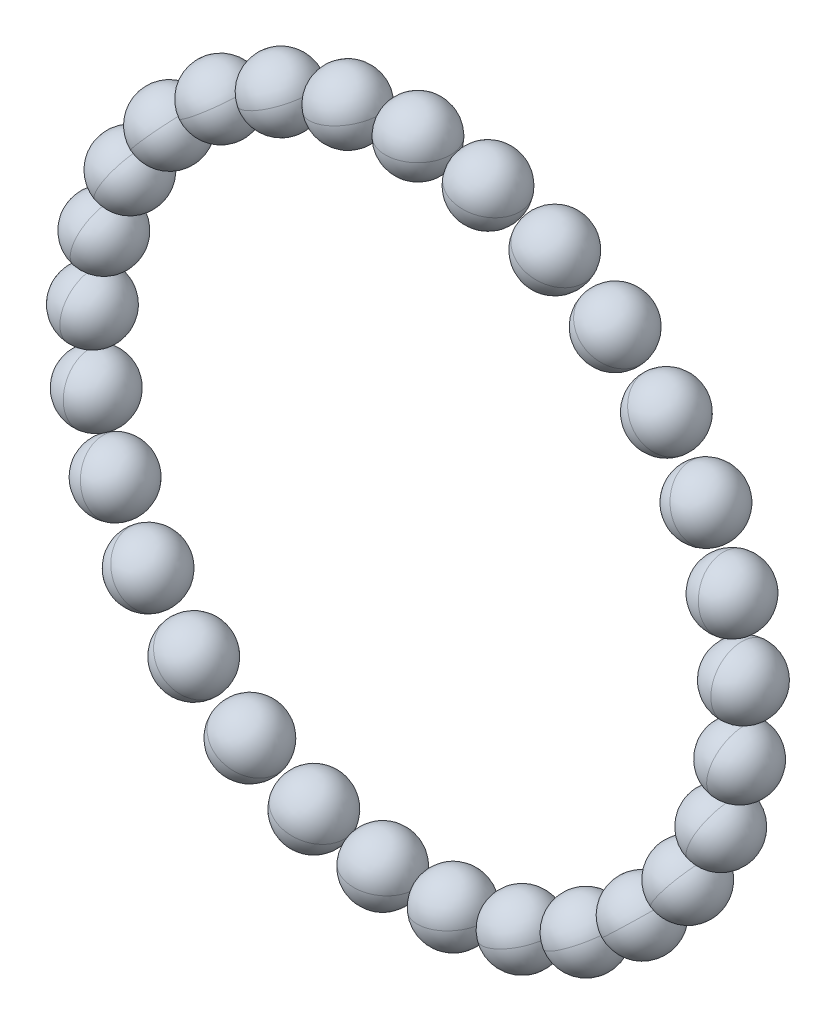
ISO-10303-21;
HEADER;
FILE_DESCRIPTION(('STEP AP214'),'2;1');
FILE_NAME('part.step','',(''),(''),'','','');
FILE_SCHEMA(('AUTOMOTIVE_DESIGN { 1 0 10303 214 1 1 1 1 }'));
ENDSEC;
DATA;
#1=APPLICATION_CONTEXT('core data for automotive mechanical design processes');
#2=APPLICATION_PROTOCOL_DEFINITION('international standard','automotive_design',2000,#1);
#3=PRODUCT_CONTEXT('',#1,'mechanical');
#4=PRODUCT('Part','Part','',(#3));
#5=PRODUCT_RELATED_PRODUCT_CATEGORY('part','',(#4));
#6=PRODUCT_DEFINITION_FORMATION('','',#4);
#7=PRODUCT_DEFINITION_CONTEXT('part definition',#1,'design');
#8=PRODUCT_DEFINITION('design','',#6,#7);
#9=PRODUCT_DEFINITION_SHAPE('','',#8);
#10=(LENGTH_UNIT() NAMED_UNIT(*) SI_UNIT(.MILLI.,.METRE.));
#11=(NAMED_UNIT(*) PLANE_ANGLE_UNIT() SI_UNIT($,.RADIAN.));
#12=(NAMED_UNIT(*) SI_UNIT($,.STERADIAN.) SOLID_ANGLE_UNIT());
#13=UNCERTAINTY_MEASURE_WITH_UNIT(LENGTH_MEASURE(1.E-05),#10,'distance_accuracy_value','');
#14=(GEOMETRIC_REPRESENTATION_CONTEXT(3) GLOBAL_UNCERTAINTY_ASSIGNED_CONTEXT((#13)) GLOBAL_UNIT_ASSIGNED_CONTEXT((#10,
#11,#12)) REPRESENTATION_CONTEXT('',''));
#15=CARTESIAN_POINT('',(0.,0.,0.));
#16=DIRECTION('',(0.,0.,1.));
#17=DIRECTION('',(1.,0.,0.));
#18=AXIS2_PLACEMENT_3D('',#15,#16,#17);
#19=CARTESIAN_POINT('',(-9.40495675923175,42.7271493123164,-9.5));
#20=DIRECTION('',(0.,0.,1.));
#21=DIRECTION('',(0.97662055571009,0.214970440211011,0.));
#22=AXIS2_PLACEMENT_3D('',#19,#20,#21);
#23=SPHERICAL_SURFACE('',#22,4.3655);
#24=CARTESIAN_POINT('',(-9.40495675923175,42.7271493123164,-9.5));
#25=DIRECTION('',(-0.214970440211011,0.976620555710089,0.));
#26=DIRECTION('',(0.,0.,-1.));
#27=AXIS2_PLACEMENT_3D('',#24,#25,#26);
#28=SPHERICAL_SURFACE('',#27,4.3655);
#29=CARTESIAN_POINT('',(-9.40495675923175,42.7271493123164,-9.5));
#30=DIRECTION('',(-0.214970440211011,0.97662055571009,0.));
#31=DIRECTION('',(0.,0.,-1.));
#32=AXIS2_PLACEMENT_3D('',#29,#30,#31);
#33=CIRCLE('',#32,4.3655);
#34=CARTESIAN_POINT('',(-9.40495675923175,42.7271493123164,-13.8655));
#35=VERTEX_POINT('',#34);
#36=CARTESIAN_POINT('',(-9.40495675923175,42.7271493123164,-5.1345));
#37=VERTEX_POINT('',#36);
#38=EDGE_CURVE('P0_E52',#35,#37,#33,.T.);
#39=ORIENTED_EDGE('',*,*,#38,.T.);
#40=CARTESIAN_POINT('',(-9.40495675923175,42.7271493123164,-9.5));
#41=DIRECTION('',(0.214970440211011,-0.97662055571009,0.));
#42=DIRECTION('',(0.,0.,-1.));
#43=AXIS2_PLACEMENT_3D('',#40,#41,#42);
#44=CIRCLE('',#43,4.3655);
#45=EDGE_CURVE('P0_E12',#35,#37,#44,.T.);
#46=ORIENTED_EDGE('',*,*,#45,.F.);
#47=EDGE_LOOP('',(#39,#46));
#48=FACE_BOUND('',#47,.T.);
#49=ADVANCED_FACE('P0_F45',(#48),#28,.T.);
#50=CARTESIAN_POINT('',(-9.40495675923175,42.7271493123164,-9.5));
#51=DIRECTION('',(0.,0.,1.));
#52=DIRECTION('',(0.97662055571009,0.214970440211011,0.));
#53=AXIS2_PLACEMENT_3D('',#50,#51,#52);
#54=SPHERICAL_SURFACE('',#53,4.3655);
#55=CARTESIAN_POINT('',(-9.40495675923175,42.7271493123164,-9.5));
#56=DIRECTION('',(0.214970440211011,-0.976620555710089,0.));
#57=DIRECTION('',(0.,0.,-1.));
#58=AXIS2_PLACEMENT_3D('',#55,#56,#57);
#59=SPHERICAL_SURFACE('',#58,4.3655);
#60=ORIENTED_EDGE('',*,*,#45,.T.);
#61=ORIENTED_EDGE('',*,*,#38,.F.);
#62=EDGE_LOOP('',(#60,#61));
#63=FACE_BOUND('',#62,.T.);
#64=ADVANCED_FACE('P0_F59',(#63),#59,.T.);
#65=CLOSED_SHELL('',(#49,#64));
#66=MANIFOLD_SOLID_BREP('P0_B2',#65);
#67=CARTESIAN_POINT('',(-18.3701481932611,39.7064246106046,-9.5));
#68=DIRECTION('',(0.,0.,1.));
#69=DIRECTION('',(0.907575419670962,0.419889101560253,0.));
#70=AXIS2_PLACEMENT_3D('',#67,#68,#69);
#71=SPHERICAL_SURFACE('',#70,4.3655);
#72=CARTESIAN_POINT('',(-18.3701481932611,39.7064246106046,-9.5));
#73=DIRECTION('',(-0.419889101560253,0.907575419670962,0.));
#74=DIRECTION('',(0.,0.,-1.));
#75=AXIS2_PLACEMENT_3D('',#72,#73,#74);
#76=SPHERICAL_SURFACE('',#75,4.3655);
#77=CARTESIAN_POINT('',(-18.3701481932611,39.7064246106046,-9.5));
#78=DIRECTION('',(-0.419889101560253,0.907575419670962,0.));
#79=DIRECTION('',(0.,0.,-1.));
#80=AXIS2_PLACEMENT_3D('',#77,#78,#79);
#81=CIRCLE('',#80,4.3655);
#82=CARTESIAN_POINT('',(-18.3701481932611,39.7064246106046,-13.8655));
#83=VERTEX_POINT('',#82);
#84=CARTESIAN_POINT('',(-18.3701481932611,39.7064246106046,-5.1345));
#85=VERTEX_POINT('',#84);
#86=EDGE_CURVE('P0_E93',#83,#85,#81,.T.);
#87=ORIENTED_EDGE('',*,*,#86,.T.);
#88=CARTESIAN_POINT('',(-18.3701481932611,39.7064246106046,-9.5));
#89=DIRECTION('',(0.419889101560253,-0.907575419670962,0.));
#90=DIRECTION('',(0.,0.,-1.));
#91=AXIS2_PLACEMENT_3D('',#88,#89,#90);
#92=CIRCLE('',#91,4.3655);
#93=EDGE_CURVE('P0_E43',#83,#85,#92,.T.);
#94=ORIENTED_EDGE('',*,*,#93,.F.);
#95=EDGE_LOOP('',(#87,#94));
#96=FACE_BOUND('',#95,.T.);
#97=ADVANCED_FACE('P0_F86',(#96),#76,.T.);
#98=CARTESIAN_POINT('',(-18.3701481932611,39.7064246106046,-9.5));
#99=DIRECTION('',(0.,0.,1.));
#100=DIRECTION('',(0.907575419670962,0.419889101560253,0.));
#101=AXIS2_PLACEMENT_3D('',#98,#99,#100);
#102=SPHERICAL_SURFACE('',#101,4.3655);
#103=CARTESIAN_POINT('',(-18.3701481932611,39.7064246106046,-9.5));
#104=DIRECTION('',(0.419889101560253,-0.907575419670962,0.));
#105=DIRECTION('',(0.,0.,-1.));
#106=AXIS2_PLACEMENT_3D('',#103,#104,#105);
#107=SPHERICAL_SURFACE('',#106,4.3655);
#108=ORIENTED_EDGE('',*,*,#93,.T.);
#109=ORIENTED_EDGE('',*,*,#86,.F.);
#110=EDGE_LOOP('',(#108,#109));
#111=FACE_BOUND('',#110,.T.);
#112=ADVANCED_FACE('P0_F100',(#111),#107,.T.);
#113=CLOSED_SHELL('',(#97,#112));
#114=MANIFOLD_SOLID_BREP('P0_B6',#113);
#115=CARTESIAN_POINT('',(-26.4763719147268,34.8290716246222,-9.5));
#116=DIRECTION('',(0.,0.,1.));
#117=DIRECTION('',(0.796093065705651,0.605174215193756,0.));
#118=AXIS2_PLACEMENT_3D('',#115,#116,#117);
#119=SPHERICAL_SURFACE('',#118,4.3655);
#120=CARTESIAN_POINT('',(-26.4763719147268,34.8290716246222,-9.5));
#121=DIRECTION('',(-0.605174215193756,0.796093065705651,0.));
#122=DIRECTION('',(0.,0.,-1.));
#123=AXIS2_PLACEMENT_3D('',#120,#121,#122);
#124=SPHERICAL_SURFACE('',#123,4.3655);
#125=CARTESIAN_POINT('',(-26.4763719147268,34.8290716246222,-9.5));
#126=DIRECTION('',(-0.605174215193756,0.796093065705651,0.));
#127=DIRECTION('',(0.,0.,-1.));
#128=AXIS2_PLACEMENT_3D('',#125,#126,#127);
#129=CIRCLE('',#128,4.3655);
#130=CARTESIAN_POINT('',(-26.4763719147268,34.8290716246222,-13.8655));
#131=VERTEX_POINT('',#130);
#132=CARTESIAN_POINT('',(-26.4763719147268,34.8290716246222,-5.1345));
#133=VERTEX_POINT('',#132);
#134=EDGE_CURVE('P0_E134',#131,#133,#129,.T.);
#135=ORIENTED_EDGE('',*,*,#134,.T.);
#136=CARTESIAN_POINT('',(-26.4763719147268,34.8290716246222,-9.5));
#137=DIRECTION('',(0.605174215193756,-0.796093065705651,0.));
#138=DIRECTION('',(0.,0.,-1.));
#139=AXIS2_PLACEMENT_3D('',#136,#137,#138);
#140=CIRCLE('',#139,4.3655);
#141=EDGE_CURVE('P0_E84',#131,#133,#140,.T.);
#142=ORIENTED_EDGE('',*,*,#141,.F.);
#143=EDGE_LOOP('',(#135,#142));
#144=FACE_BOUND('',#143,.T.);
#145=ADVANCED_FACE('P0_F127',(#144),#124,.T.);
#146=CARTESIAN_POINT('',(-26.4763719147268,34.8290716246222,-9.5));
#147=DIRECTION('',(0.,0.,1.));
#148=DIRECTION('',(0.796093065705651,0.605174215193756,0.));
#149=AXIS2_PLACEMENT_3D('',#146,#147,#148);
#150=SPHERICAL_SURFACE('',#149,4.3655);
#151=CARTESIAN_POINT('',(-26.4763719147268,34.8290716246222,-9.5));
#152=DIRECTION('',(0.605174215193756,-0.796093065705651,0.));
#153=DIRECTION('',(0.,0.,-1.));
#154=AXIS2_PLACEMENT_3D('',#151,#152,#153);
#155=SPHERICAL_SURFACE('',#154,4.3655);
#156=ORIENTED_EDGE('',*,*,#141,.T.);
#157=ORIENTED_EDGE('',*,*,#134,.F.);
#158=EDGE_LOOP('',(#156,#157));
#159=FACE_BOUND('',#158,.T.);
#160=ADVANCED_FACE('P0_F141',(#159),#155,.T.);
#161=CLOSED_SHELL('',(#145,#160));
#162=MANIFOLD_SOLID_BREP('P0_B37',#161);
#163=CARTESIAN_POINT('',(-33.3445899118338,28.3231499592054,-9.5));
#164=DIRECTION('',(0.,0.,1.));
#165=DIRECTION('',(0.647386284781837,0.762162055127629,0.));
#166=AXIS2_PLACEMENT_3D('',#163,#164,#165);
#167=SPHERICAL_SURFACE('',#166,4.3655);
#168=CARTESIAN_POINT('',(-33.3445899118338,28.3231499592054,-9.5));
#169=DIRECTION('',(-0.762162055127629,0.647386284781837,0.));
#170=DIRECTION('',(0.,0.,-1.));
#171=AXIS2_PLACEMENT_3D('',#168,#169,#170);
#172=SPHERICAL_SURFACE('',#171,4.3655);
#173=CARTESIAN_POINT('',(-33.3445899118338,28.3231499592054,-9.5));
#174=DIRECTION('',(-0.762162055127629,0.647386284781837,0.));
#175=DIRECTION('',(0.,0.,-1.));
#176=AXIS2_PLACEMENT_3D('',#173,#174,#175);
#177=CIRCLE('',#176,4.3655);
#178=CARTESIAN_POINT('',(-33.3445899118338,28.3231499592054,-13.8655));
#179=VERTEX_POINT('',#178);
#180=CARTESIAN_POINT('',(-33.3445899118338,28.3231499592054,-5.1345));
#181=VERTEX_POINT('',#180);
#182=EDGE_CURVE('P0_E175',#179,#181,#177,.T.);
#183=ORIENTED_EDGE('',*,*,#182,.T.);
#184=CARTESIAN_POINT('',(-33.3445899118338,28.3231499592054,-9.5));
#185=DIRECTION('',(0.762162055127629,-0.647386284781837,0.));
#186=DIRECTION('',(0.,0.,-1.));
#187=AXIS2_PLACEMENT_3D('',#184,#185,#186);
#188=CIRCLE('',#187,4.3655);
#189=EDGE_CURVE('P0_E125',#179,#181,#188,.T.);
#190=ORIENTED_EDGE('',*,*,#189,.F.);
#191=EDGE_LOOP('',(#183,#190));
#192=FACE_BOUND('',#191,.T.);
#193=ADVANCED_FACE('P0_F168',(#192),#172,.T.);
#194=CARTESIAN_POINT('',(-33.3445899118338,28.3231499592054,-9.5));
#195=DIRECTION('',(0.,0.,1.));
#196=DIRECTION('',(0.647386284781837,0.762162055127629,0.));
#197=AXIS2_PLACEMENT_3D('',#194,#195,#196);
#198=SPHERICAL_SURFACE('',#197,4.3655);
#199=CARTESIAN_POINT('',(-33.3445899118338,28.3231499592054,-9.5));
#200=DIRECTION('',(0.762162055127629,-0.647386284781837,0.));
#201=DIRECTION('',(0.,0.,-1.));
#202=AXIS2_PLACEMENT_3D('',#199,#200,#201);
#203=SPHERICAL_SURFACE('',#202,4.3655);
#204=ORIENTED_EDGE('',*,*,#189,.T.);
#205=ORIENTED_EDGE('',*,*,#182,.F.);
#206=EDGE_LOOP('',(#204,#205));
#207=FACE_BOUND('',#206,.T.);
#208=ADVANCED_FACE('P0_F182',(#207),#203,.T.);
#209=CLOSED_SHELL('',(#193,#208));
#210=MANIFOLD_SOLID_BREP('P0_B78',#209);
#211=CARTESIAN_POINT('',(-38.6536519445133,20.4928692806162,-9.5));
#212=DIRECTION('',(0.,0.,1.));
#213=DIRECTION('',(0.4684084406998,0.883512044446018,0.));
#214=AXIS2_PLACEMENT_3D('',#211,#212,#213);
#215=SPHERICAL_SURFACE('',#214,4.3655);
#216=CARTESIAN_POINT('',(-38.6536519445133,20.4928692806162,-9.5));
#217=DIRECTION('',(-0.883512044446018,0.4684084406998,0.));
#218=DIRECTION('',(0.,0.,-1.));
#219=AXIS2_PLACEMENT_3D('',#216,#217,#218);
#220=SPHERICAL_SURFACE('',#219,4.3655);
#221=CARTESIAN_POINT('',(-38.6536519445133,20.4928692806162,-9.5));
#222=DIRECTION('',(-0.883512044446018,0.4684084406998,0.));
#223=DIRECTION('',(0.,0.,-1.));
#224=AXIS2_PLACEMENT_3D('',#221,#222,#223);
#225=CIRCLE('',#224,4.3655);
#226=CARTESIAN_POINT('',(-38.6536519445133,20.4928692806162,-13.8655));
#227=VERTEX_POINT('',#226);
#228=CARTESIAN_POINT('',(-38.6536519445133,20.4928692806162,-5.1345));
#229=VERTEX_POINT('',#228);
#230=EDGE_CURVE('P0_E216',#227,#229,#225,.T.);
#231=ORIENTED_EDGE('',*,*,#230,.T.);
#232=CARTESIAN_POINT('',(-38.6536519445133,20.4928692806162,-9.5));
#233=DIRECTION('',(0.883512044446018,-0.4684084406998,0.));
#234=DIRECTION('',(0.,0.,-1.));
#235=AXIS2_PLACEMENT_3D('',#232,#233,#234);
#236=CIRCLE('',#235,4.3655);
#237=EDGE_CURVE('P0_E166',#227,#229,#236,.T.);
#238=ORIENTED_EDGE('',*,*,#237,.F.);
#239=EDGE_LOOP('',(#231,#238));
#240=FACE_BOUND('',#239,.T.);
#241=ADVANCED_FACE('P0_F209',(#240),#220,.T.);
#242=CARTESIAN_POINT('',(-38.6536519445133,20.4928692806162,-9.5));
#243=DIRECTION('',(0.,0.,1.));
#244=DIRECTION('',(0.4684084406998,0.883512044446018,0.));
#245=AXIS2_PLACEMENT_3D('',#242,#243,#244);
#246=SPHERICAL_SURFACE('',#245,4.3655);
#247=CARTESIAN_POINT('',(-38.6536519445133,20.4928692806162,-9.5));
#248=DIRECTION('',(0.883512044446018,-0.4684084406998,0.));
#249=DIRECTION('',(0.,0.,-1.));
#250=AXIS2_PLACEMENT_3D('',#247,#248,#249);
#251=SPHERICAL_SURFACE('',#250,4.3655);
#252=ORIENTED_EDGE('',*,*,#237,.T.);
#253=ORIENTED_EDGE('',*,*,#230,.F.);
#254=EDGE_LOOP('',(#252,#253));
#255=FACE_BOUND('',#254,.T.);
#256=ADVANCED_FACE('P0_F223',(#255),#251,.T.);
#257=CLOSED_SHELL('',(#241,#256));
#258=MANIFOLD_SOLID_BREP('P0_B119',#257);
#259=CARTESIAN_POINT('',(-42.1553121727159,11.7043648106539,-9.5));
#260=DIRECTION('',(0.,0.,1.));
#261=DIRECTION('',(0.267528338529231,0.96354999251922,0.));
#262=AXIS2_PLACEMENT_3D('',#259,#260,#261);
#263=SPHERICAL_SURFACE('',#262,4.3655);
#264=CARTESIAN_POINT('',(-42.1553121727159,11.7043648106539,-9.5));
#265=DIRECTION('',(-0.96354999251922,0.267528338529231,0.));
#266=DIRECTION('',(0.,0.,-1.));
#267=AXIS2_PLACEMENT_3D('',#264,#265,#266);
#268=SPHERICAL_SURFACE('',#267,4.3655);
#269=CARTESIAN_POINT('',(-42.1553121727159,11.7043648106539,-9.5));
#270=DIRECTION('',(-0.96354999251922,0.267528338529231,0.));
#271=DIRECTION('',(0.,0.,-1.));
#272=AXIS2_PLACEMENT_3D('',#269,#270,#271);
#273=CIRCLE('',#272,4.3655);
#274=CARTESIAN_POINT('',(-42.1553121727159,11.7043648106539,-13.8655));
#275=VERTEX_POINT('',#274);
#276=CARTESIAN_POINT('',(-42.1553121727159,11.7043648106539,-5.1345));
#277=VERTEX_POINT('',#276);
#278=EDGE_CURVE('P0_E257',#275,#277,#273,.T.);
#279=ORIENTED_EDGE('',*,*,#278,.T.);
#280=CARTESIAN_POINT('',(-42.1553121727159,11.7043648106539,-9.5));
#281=DIRECTION('',(0.96354999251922,-0.267528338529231,0.));
#282=DIRECTION('',(0.,0.,-1.));
#283=AXIS2_PLACEMENT_3D('',#280,#281,#282);
#284=CIRCLE('',#283,4.3655);
#285=EDGE_CURVE('P0_E207',#275,#277,#284,.T.);
#286=ORIENTED_EDGE('',*,*,#285,.F.);
#287=EDGE_LOOP('',(#279,#286));
#288=FACE_BOUND('',#287,.T.);
#289=ADVANCED_FACE('P0_F250',(#288),#268,.T.);
#290=CARTESIAN_POINT('',(-42.1553121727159,11.7043648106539,-9.5));
#291=DIRECTION('',(0.,0.,1.));
#292=DIRECTION('',(0.267528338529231,0.96354999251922,0.));
#293=AXIS2_PLACEMENT_3D('',#290,#291,#292);
#294=SPHERICAL_SURFACE('',#293,4.3655);
#295=CARTESIAN_POINT('',(-42.1553121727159,11.7043648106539,-9.5));
#296=DIRECTION('',(0.96354999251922,-0.267528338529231,0.));
#297=DIRECTION('',(0.,0.,-1.));
#298=AXIS2_PLACEMENT_3D('',#295,#296,#297);
#299=SPHERICAL_SURFACE('',#298,4.3655);
#300=ORIENTED_EDGE('',*,*,#285,.T.);
#301=ORIENTED_EDGE('',*,*,#278,.F.);
#302=EDGE_LOOP('',(#300,#301));
#303=FACE_BOUND('',#302,.T.);
#304=ADVANCED_FACE('P0_F264',(#303),#299,.T.);
#305=CLOSED_SHELL('',(#289,#304));
#306=MANIFOLD_SOLID_BREP('P0_B160',#305);
#307=CARTESIAN_POINT('',(-43.6858368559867,2.36857725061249,-9.5));
#308=DIRECTION('',(0.,0.,1.));
#309=DIRECTION('',(0.0541389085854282,0.998533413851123,0.));
#310=AXIS2_PLACEMENT_3D('',#307,#308,#309);
#311=SPHERICAL_SURFACE('',#310,4.3655);
#312=CARTESIAN_POINT('',(-43.6858368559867,2.36857725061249,-9.5));
#313=DIRECTION('',(-0.998533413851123,0.0541389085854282,0.));
#314=DIRECTION('',(0.,0.,-1.));
#315=AXIS2_PLACEMENT_3D('',#312,#313,#314);
#316=SPHERICAL_SURFACE('',#315,4.3655);
#317=CARTESIAN_POINT('',(-43.6858368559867,2.36857725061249,-9.5));
#318=DIRECTION('',(-0.998533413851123,0.0541389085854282,0.));
#319=DIRECTION('',(0.,0.,-1.));
#320=AXIS2_PLACEMENT_3D('',#317,#318,#319);
#321=CIRCLE('',#320,4.3655);
#322=CARTESIAN_POINT('',(-43.6858368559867,2.36857725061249,-13.8655));
#323=VERTEX_POINT('',#322);
#324=CARTESIAN_POINT('',(-43.6858368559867,2.36857725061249,-5.1345));
#325=VERTEX_POINT('',#324);
#326=EDGE_CURVE('P0_E298',#323,#325,#321,.T.);
#327=ORIENTED_EDGE('',*,*,#326,.T.);
#328=CARTESIAN_POINT('',(-43.6858368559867,2.36857725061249,-9.5));
#329=DIRECTION('',(0.998533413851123,-0.0541389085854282,0.));
#330=DIRECTION('',(0.,0.,-1.));
#331=AXIS2_PLACEMENT_3D('',#328,#329,#330);
#332=CIRCLE('',#331,4.3655);
#333=EDGE_CURVE('P0_E248',#323,#325,#332,.T.);
#334=ORIENTED_EDGE('',*,*,#333,.F.);
#335=EDGE_LOOP('',(#327,#334));
#336=FACE_BOUND('',#335,.T.);
#337=ADVANCED_FACE('P0_F291',(#336),#316,.T.);
#338=CARTESIAN_POINT('',(-43.6858368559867,2.36857725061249,-9.5));
#339=DIRECTION('',(0.,0.,1.));
#340=DIRECTION('',(0.0541389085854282,0.998533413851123,0.));
#341=AXIS2_PLACEMENT_3D('',#338,#339,#340);
#342=SPHERICAL_SURFACE('',#341,4.3655);
#343=CARTESIAN_POINT('',(-43.6858368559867,2.36857725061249,-9.5));
#344=DIRECTION('',(0.998533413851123,-0.0541389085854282,0.));
#345=DIRECTION('',(0.,0.,-1.));
#346=AXIS2_PLACEMENT_3D('',#343,#344,#345);
#347=SPHERICAL_SURFACE('',#346,4.3655);
#348=ORIENTED_EDGE('',*,*,#333,.T.);
#349=ORIENTED_EDGE('',*,*,#326,.F.);
#350=EDGE_LOOP('',(#348,#349));
#351=FACE_BOUND('',#350,.T.);
#352=ADVANCED_FACE('P0_F305',(#351),#347,.T.);
#353=CLOSED_SHELL('',(#337,#352));
#354=MANIFOLD_SOLID_BREP('P0_B201',#353);
#355=CARTESIAN_POINT('',(-43.1736603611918,-7.07796234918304,-9.5));
#356=DIRECTION('',(0.,0.,1.));
#357=DIRECTION('',(-0.161781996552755,0.986826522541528,0.));
#358=AXIS2_PLACEMENT_3D('',#355,#356,#357);
#359=SPHERICAL_SURFACE('',#358,4.3655);
#360=CARTESIAN_POINT('',(-43.1736603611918,-7.07796234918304,-9.5));
#361=DIRECTION('',(-0.986826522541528,-0.161781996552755,0.));
#362=DIRECTION('',(0.,0.,-1.));
#363=AXIS2_PLACEMENT_3D('',#360,#361,#362);
#364=SPHERICAL_SURFACE('',#363,4.3655);
#365=CARTESIAN_POINT('',(-43.1736603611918,-7.07796234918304,-9.5));
#366=DIRECTION('',(-0.986826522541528,-0.161781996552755,0.));
#367=DIRECTION('',(0.,0.,-1.));
#368=AXIS2_PLACEMENT_3D('',#365,#366,#367);
#369=CIRCLE('',#368,4.3655);
#370=CARTESIAN_POINT('',(-43.1736603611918,-7.07796234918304,-13.8655));
#371=VERTEX_POINT('',#370);
#372=CARTESIAN_POINT('',(-43.1736603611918,-7.07796234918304,-5.1345));
#373=VERTEX_POINT('',#372);
#374=EDGE_CURVE('P0_E339',#371,#373,#369,.T.);
#375=ORIENTED_EDGE('',*,*,#374,.T.);
#376=CARTESIAN_POINT('',(-43.1736603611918,-7.07796234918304,-9.5));
#377=DIRECTION('',(0.986826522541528,0.161781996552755,0.));
#378=DIRECTION('',(0.,0.,-1.));
#379=AXIS2_PLACEMENT_3D('',#376,#377,#378);
#380=CIRCLE('',#379,4.3655);
#381=EDGE_CURVE('P0_E289',#371,#373,#380,.T.);
#382=ORIENTED_EDGE('',*,*,#381,.F.);
#383=EDGE_LOOP('',(#375,#382));
#384=FACE_BOUND('',#383,.T.);
#385=ADVANCED_FACE('P0_F332',(#384),#364,.T.);
#386=CARTESIAN_POINT('',(-43.1736603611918,-7.07796234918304,-9.5));
#387=DIRECTION('',(0.,0.,1.));
#388=DIRECTION('',(-0.161781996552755,0.986826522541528,0.));
#389=AXIS2_PLACEMENT_3D('',#386,#387,#388);
#390=SPHERICAL_SURFACE('',#389,4.3655);
#391=CARTESIAN_POINT('',(-43.1736603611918,-7.07796234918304,-9.5));
#392=DIRECTION('',(0.986826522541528,0.161781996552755,0.));
#393=DIRECTION('',(0.,0.,-1.));
#394=AXIS2_PLACEMENT_3D('',#391,#392,#393);
#395=SPHERICAL_SURFACE('',#394,4.3655);
#396=ORIENTED_EDGE('',*,*,#381,.T.);
#397=ORIENTED_EDGE('',*,*,#374,.F.);
#398=EDGE_LOOP('',(#396,#397));
#399=FACE_BOUND('',#398,.T.);
#400=ADVANCED_FACE('P0_F346',(#399),#395,.T.);
#401=CLOSED_SHELL('',(#385,#400));
#402=MANIFOLD_SOLID_BREP('P0_B242',#401);
#403=CARTESIAN_POINT('',(-40.6427314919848,-16.1935442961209,-9.5));
#404=DIRECTION('',(0.,0.,1.));
#405=DIRECTION('',(-0.370138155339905,0.928976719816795,0.));
#406=AXIS2_PLACEMENT_3D('',#403,#404,#405);
#407=SPHERICAL_SURFACE('',#406,4.3655);
#408=CARTESIAN_POINT('',(-40.6427314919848,-16.1935442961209,-9.5));
#409=DIRECTION('',(-0.928976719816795,-0.370138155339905,0.));
#410=DIRECTION('',(0.,0.,-1.));
#411=AXIS2_PLACEMENT_3D('',#408,#409,#410);
#412=SPHERICAL_SURFACE('',#411,4.3655);
#413=CARTESIAN_POINT('',(-40.6427314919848,-16.1935442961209,-9.5));
#414=DIRECTION('',(-0.928976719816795,-0.370138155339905,0.));
#415=DIRECTION('',(0.,0.,-1.));
#416=AXIS2_PLACEMENT_3D('',#413,#414,#415);
#417=CIRCLE('',#416,4.3655);
#418=CARTESIAN_POINT('',(-40.6427314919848,-16.1935442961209,-13.8655));
#419=VERTEX_POINT('',#418);
#420=CARTESIAN_POINT('',(-40.6427314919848,-16.1935442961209,-5.1345));
#421=VERTEX_POINT('',#420);
#422=EDGE_CURVE('P0_E380',#419,#421,#417,.T.);
#423=ORIENTED_EDGE('',*,*,#422,.T.);
#424=CARTESIAN_POINT('',(-40.6427314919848,-16.1935442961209,-9.5));
#425=DIRECTION('',(0.928976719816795,0.370138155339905,0.));
#426=DIRECTION('',(0.,0.,-1.));
#427=AXIS2_PLACEMENT_3D('',#424,#425,#426);
#428=CIRCLE('',#427,4.3655);
#429=EDGE_CURVE('P0_E330',#419,#421,#428,.T.);
#430=ORIENTED_EDGE('',*,*,#429,.F.);
#431=EDGE_LOOP('',(#423,#430));
#432=FACE_BOUND('',#431,.T.);
#433=ADVANCED_FACE('P0_F373',(#432),#412,.T.);
#434=CARTESIAN_POINT('',(-40.6427314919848,-16.1935442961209,-9.5));
#435=DIRECTION('',(0.,0.,1.));
#436=DIRECTION('',(-0.370138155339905,0.928976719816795,0.));
#437=AXIS2_PLACEMENT_3D('',#434,#435,#436);
#438=SPHERICAL_SURFACE('',#437,4.3655);
#439=CARTESIAN_POINT('',(-40.6427314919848,-16.1935442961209,-9.5));
#440=DIRECTION('',(0.928976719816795,0.370138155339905,0.));
#441=DIRECTION('',(0.,0.,-1.));
#442=AXIS2_PLACEMENT_3D('',#439,#440,#441);
#443=SPHERICAL_SURFACE('',#442,4.3655);
#444=ORIENTED_EDGE('',*,*,#429,.T.);
#445=ORIENTED_EDGE('',*,*,#422,.F.);
#446=EDGE_LOOP('',(#444,#445));
#447=FACE_BOUND('',#446,.T.);
#448=ADVANCED_FACE('P0_F387',(#447),#443,.T.);
#449=CLOSED_SHELL('',(#433,#448));
#450=MANIFOLD_SOLID_BREP('P0_B283',#449);
#451=CARTESIAN_POINT('',(-36.2113936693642,-24.5519341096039,-9.5));
#452=DIRECTION('',(0.,0.,1.));
#453=DIRECTION('',(-0.561187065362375,0.827688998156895,0.));
#454=AXIS2_PLACEMENT_3D('',#451,#452,#453);
#455=SPHERICAL_SURFACE('',#454,4.3655);
#456=CARTESIAN_POINT('',(-36.2113936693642,-24.5519341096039,-9.5));
#457=DIRECTION('',(-0.827688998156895,-0.561187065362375,0.));
#458=DIRECTION('',(0.,0.,-1.));
#459=AXIS2_PLACEMENT_3D('',#456,#457,#458);
#460=SPHERICAL_SURFACE('',#459,4.3655);
#461=CARTESIAN_POINT('',(-36.2113936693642,-24.5519341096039,-9.5));
#462=DIRECTION('',(-0.827688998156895,-0.561187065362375,0.));
#463=DIRECTION('',(0.,0.,-1.));
#464=AXIS2_PLACEMENT_3D('',#461,#462,#463);
#465=CIRCLE('',#464,4.3655);
#466=CARTESIAN_POINT('',(-36.2113936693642,-24.5519341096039,-13.8655));
#467=VERTEX_POINT('',#466);
#468=CARTESIAN_POINT('',(-36.2113936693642,-24.5519341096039,-5.1345));
#469=VERTEX_POINT('',#468);
#470=EDGE_CURVE('P0_E421',#467,#469,#465,.T.);
#471=ORIENTED_EDGE('',*,*,#470,.T.);
#472=CARTESIAN_POINT('',(-36.2113936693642,-24.5519341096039,-9.5));
#473=DIRECTION('',(0.827688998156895,0.561187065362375,0.));
#474=DIRECTION('',(0.,0.,-1.));
#475=AXIS2_PLACEMENT_3D('',#472,#473,#474);
#476=CIRCLE('',#475,4.3655);
#477=EDGE_CURVE('P0_E371',#467,#469,#476,.T.);
#478=ORIENTED_EDGE('',*,*,#477,.F.);
#479=EDGE_LOOP('',(#471,#478));
#480=FACE_BOUND('',#479,.T.);
#481=ADVANCED_FACE('P0_F414',(#480),#460,.T.);
#482=CARTESIAN_POINT('',(-36.2113936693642,-24.5519341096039,-9.5));
#483=DIRECTION('',(0.,0.,1.));
#484=DIRECTION('',(-0.561187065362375,0.827688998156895,0.));
#485=AXIS2_PLACEMENT_3D('',#482,#483,#484);
#486=SPHERICAL_SURFACE('',#485,4.3655);
#487=CARTESIAN_POINT('',(-36.2113936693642,-24.5519341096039,-9.5));
#488=DIRECTION('',(0.827688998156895,0.561187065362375,0.));
#489=DIRECTION('',(0.,0.,-1.));
#490=AXIS2_PLACEMENT_3D('',#487,#488,#489);
#491=SPHERICAL_SURFACE('',#490,4.3655);
#492=ORIENTED_EDGE('',*,*,#477,.T.);
#493=ORIENTED_EDGE('',*,*,#470,.F.);
#494=EDGE_LOOP('',(#492,#493));
#495=FACE_BOUND('',#494,.T.);
#496=ADVANCED_FACE('P0_F428',(#495),#491,.T.);
#497=CLOSED_SHELL('',(#481,#496));
#498=MANIFOLD_SOLID_BREP('P0_B324',#497);
#499=CARTESIAN_POINT('',(-30.0868513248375,-31.7623027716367,-9.5));
#500=DIRECTION('',(0.,0.,1.));
#501=DIRECTION('',(-0.725995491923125,0.68769945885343,0.));
#502=AXIS2_PLACEMENT_3D('',#499,#500,#501);
#503=SPHERICAL_SURFACE('',#502,4.3655);
#504=CARTESIAN_POINT('',(-30.0868513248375,-31.7623027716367,-9.5));
#505=DIRECTION('',(-0.68769945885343,-0.725995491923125,0.));
#506=DIRECTION('',(0.,0.,-1.));
#507=AXIS2_PLACEMENT_3D('',#504,#505,#506);
#508=SPHERICAL_SURFACE('',#507,4.3655);
#509=CARTESIAN_POINT('',(-30.0868513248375,-31.7623027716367,-9.5));
#510=DIRECTION('',(-0.68769945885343,-0.725995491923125,0.));
#511=DIRECTION('',(0.,0.,-1.));
#512=AXIS2_PLACEMENT_3D('',#509,#510,#511);
#513=CIRCLE('',#512,4.3655);
#514=CARTESIAN_POINT('',(-30.0868513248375,-31.7623027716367,-13.8655));
#515=VERTEX_POINT('',#514);
#516=CARTESIAN_POINT('',(-30.0868513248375,-31.7623027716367,-5.1345));
#517=VERTEX_POINT('',#516);
#518=EDGE_CURVE('P0_E462',#515,#517,#513,.T.);
#519=ORIENTED_EDGE('',*,*,#518,.T.);
#520=CARTESIAN_POINT('',(-30.0868513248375,-31.7623027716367,-9.5));
#521=DIRECTION('',(0.68769945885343,0.725995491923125,0.));
#522=DIRECTION('',(0.,0.,-1.));
#523=AXIS2_PLACEMENT_3D('',#520,#521,#522);
#524=CIRCLE('',#523,4.3655);
#525=EDGE_CURVE('P0_E412',#515,#517,#524,.T.);
#526=ORIENTED_EDGE('',*,*,#525,.F.);
#527=EDGE_LOOP('',(#519,#526));
#528=FACE_BOUND('',#527,.T.);
#529=ADVANCED_FACE('P0_F455',(#528),#508,.T.);
#530=CARTESIAN_POINT('',(-30.0868513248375,-31.7623027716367,-9.5));
#531=DIRECTION('',(0.,0.,1.));
#532=DIRECTION('',(-0.725995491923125,0.68769945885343,0.));
#533=AXIS2_PLACEMENT_3D('',#530,#531,#532);
#534=SPHERICAL_SURFACE('',#533,4.3655);
#535=CARTESIAN_POINT('',(-30.0868513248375,-31.7623027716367,-9.5));
#536=DIRECTION('',(0.68769945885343,0.725995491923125,0.));
#537=DIRECTION('',(0.,0.,-1.));
#538=AXIS2_PLACEMENT_3D('',#535,#536,#537);
#539=SPHERICAL_SURFACE('',#538,4.3655);
#540=ORIENTED_EDGE('',*,*,#525,.T.);
#541=ORIENTED_EDGE('',*,*,#518,.F.);
#542=EDGE_LOOP('',(#540,#541));
#543=FACE_BOUND('',#542,.T.);
#544=ADVANCED_FACE('P0_F469',(#543),#539,.T.);
#545=CLOSED_SHELL('',(#529,#544));
#546=MANIFOLD_SOLID_BREP('P0_B365',#545);
#547=CARTESIAN_POINT('',(-22.555481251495,-37.4875014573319,-9.5));
#548=DIRECTION('',(0.,0.,1.));
#549=DIRECTION('',(-0.856857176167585,0.515553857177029,0.));
#550=AXIS2_PLACEMENT_3D('',#547,#548,#549);
#551=SPHERICAL_SURFACE('',#550,4.3655);
#552=CARTESIAN_POINT('',(-22.555481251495,-37.4875014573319,-9.5));
#553=DIRECTION('',(-0.515553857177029,-0.856857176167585,0.));
#554=DIRECTION('',(0.,0.,-1.));
#555=AXIS2_PLACEMENT_3D('',#552,#553,#554);
#556=SPHERICAL_SURFACE('',#555,4.3655);
#557=CARTESIAN_POINT('',(-22.555481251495,-37.4875014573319,-9.5));
#558=DIRECTION('',(-0.515553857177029,-0.856857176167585,0.));
#559=DIRECTION('',(0.,0.,-1.));
#560=AXIS2_PLACEMENT_3D('',#557,#558,#559);
#561=CIRCLE('',#560,4.3655);
#562=CARTESIAN_POINT('',(-22.555481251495,-37.4875014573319,-13.8655));
#563=VERTEX_POINT('',#562);
#564=CARTESIAN_POINT('',(-22.555481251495,-37.4875014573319,-5.1345));
#565=VERTEX_POINT('',#564);
#566=EDGE_CURVE('P0_E503',#563,#565,#561,.T.);
#567=ORIENTED_EDGE('',*,*,#566,.T.);
#568=CARTESIAN_POINT('',(-22.555481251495,-37.4875014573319,-9.5));
#569=DIRECTION('',(0.515553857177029,0.856857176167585,0.));
#570=DIRECTION('',(0.,0.,-1.));
#571=AXIS2_PLACEMENT_3D('',#568,#569,#570);
#572=CIRCLE('',#571,4.3655);
#573=EDGE_CURVE('P0_E453',#563,#565,#572,.T.);
#574=ORIENTED_EDGE('',*,*,#573,.F.);
#575=EDGE_LOOP('',(#567,#574));
#576=FACE_BOUND('',#575,.T.);
#577=ADVANCED_FACE('P0_F496',(#576),#556,.T.);
#578=CARTESIAN_POINT('',(-22.555481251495,-37.4875014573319,-9.5));
#579=DIRECTION('',(0.,0.,1.));
#580=DIRECTION('',(-0.856857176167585,0.515553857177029,0.));
#581=AXIS2_PLACEMENT_3D('',#578,#579,#580);
#582=SPHERICAL_SURFACE('',#581,4.3655);
#583=CARTESIAN_POINT('',(-22.555481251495,-37.4875014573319,-9.5));
#584=DIRECTION('',(0.515553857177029,0.856857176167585,0.));
#585=DIRECTION('',(0.,0.,-1.));
#586=AXIS2_PLACEMENT_3D('',#583,#584,#585);
#587=SPHERICAL_SURFACE('',#586,4.3655);
#588=ORIENTED_EDGE('',*,*,#573,.T.);
#589=ORIENTED_EDGE('',*,*,#566,.F.);
#590=EDGE_LOOP('',(#588,#589));
#591=FACE_BOUND('',#590,.T.);
#592=ADVANCED_FACE('P0_F510',(#591),#587,.T.);
#593=CLOSED_SHELL('',(#577,#592));
#594=MANIFOLD_SOLID_BREP('P0_B406',#593);
#595=CARTESIAN_POINT('',(-13.9694419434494,-41.4598262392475,-9.5));
#596=DIRECTION('',(0.,0.,1.));
#597=DIRECTION('',(-0.9476531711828,0.319301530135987,0.));
#598=AXIS2_PLACEMENT_3D('',#595,#596,#597);
#599=SPHERICAL_SURFACE('',#598,4.3655);
#600=CARTESIAN_POINT('',(-13.9694419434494,-41.4598262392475,-9.5));
#601=DIRECTION('',(-0.319301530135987,-0.9476531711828,0.));
#602=DIRECTION('',(0.,0.,-1.));
#603=AXIS2_PLACEMENT_3D('',#600,#601,#602);
#604=SPHERICAL_SURFACE('',#603,4.3655);
#605=CARTESIAN_POINT('',(-13.9694419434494,-41.4598262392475,-9.5));
#606=DIRECTION('',(-0.319301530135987,-0.9476531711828,0.));
#607=DIRECTION('',(0.,0.,-1.));
#608=AXIS2_PLACEMENT_3D('',#605,#606,#607);
#609=CIRCLE('',#608,4.3655);
#610=CARTESIAN_POINT('',(-13.9694419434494,-41.4598262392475,-13.8655));
#611=VERTEX_POINT('',#610);
#612=CARTESIAN_POINT('',(-13.9694419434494,-41.4598262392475,-5.1345));
#613=VERTEX_POINT('',#612);
#614=EDGE_CURVE('P0_E544',#611,#613,#609,.T.);
#615=ORIENTED_EDGE('',*,*,#614,.T.);
#616=CARTESIAN_POINT('',(-13.9694419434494,-41.4598262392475,-9.5));
#617=DIRECTION('',(0.319301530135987,0.9476531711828,0.));
#618=DIRECTION('',(0.,0.,-1.));
#619=AXIS2_PLACEMENT_3D('',#616,#617,#618);
#620=CIRCLE('',#619,4.3655);
#621=EDGE_CURVE('P0_E494',#611,#613,#620,.T.);
#622=ORIENTED_EDGE('',*,*,#621,.F.);
#623=EDGE_LOOP('',(#615,#622));
#624=FACE_BOUND('',#623,.T.);
#625=ADVANCED_FACE('P0_F537',(#624),#604,.T.);
#626=CARTESIAN_POINT('',(-13.9694419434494,-41.4598262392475,-9.5));
#627=DIRECTION('',(0.,0.,1.));
#628=DIRECTION('',(-0.9476531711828,0.319301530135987,0.));
#629=AXIS2_PLACEMENT_3D('',#626,#627,#628);
#630=SPHERICAL_SURFACE('',#629,4.3655);
#631=CARTESIAN_POINT('',(-13.9694419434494,-41.4598262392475,-9.5));
#632=DIRECTION('',(0.319301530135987,0.9476531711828,0.));
#633=DIRECTION('',(0.,0.,-1.));
#634=AXIS2_PLACEMENT_3D('',#631,#632,#633);
#635=SPHERICAL_SURFACE('',#634,4.3655);
#636=ORIENTED_EDGE('',*,*,#621,.T.);
#637=ORIENTED_EDGE('',*,*,#614,.F.);
#638=EDGE_LOOP('',(#636,#637));
#639=FACE_BOUND('',#638,.T.);
#640=ADVANCED_FACE('P0_F551',(#639),#635,.T.);
#641=CLOSED_SHELL('',(#625,#640));
#642=MANIFOLD_SOLID_BREP('P0_B447',#641);
#643=CARTESIAN_POINT('',(-4.73020705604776,-43.4935356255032,-9.5));
#644=DIRECTION('',(0.,0.,1.));
#645=DIRECTION('',(-0.994137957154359,0.108119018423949,0.));
#646=AXIS2_PLACEMENT_3D('',#643,#644,#645);
#647=SPHERICAL_SURFACE('',#646,4.3655);
#648=CARTESIAN_POINT('',(-4.73020705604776,-43.4935356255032,-9.5));
#649=DIRECTION('',(-0.108119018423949,-0.994137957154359,0.));
#650=DIRECTION('',(0.,0.,-1.));
#651=AXIS2_PLACEMENT_3D('',#648,#649,#650);
#652=SPHERICAL_SURFACE('',#651,4.3655);
#653=CARTESIAN_POINT('',(-4.73020705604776,-43.4935356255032,-9.5));
#654=DIRECTION('',(-0.108119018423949,-0.994137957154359,0.));
#655=DIRECTION('',(0.,0.,-1.));
#656=AXIS2_PLACEMENT_3D('',#653,#654,#655);
#657=CIRCLE('',#656,4.3655);
#658=CARTESIAN_POINT('',(-4.73020705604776,-43.4935356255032,-13.8655));
#659=VERTEX_POINT('',#658);
#660=CARTESIAN_POINT('',(-4.73020705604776,-43.4935356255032,-5.1345));
#661=VERTEX_POINT('',#660);
#662=EDGE_CURVE('P0_E585',#659,#661,#657,.T.);
#663=ORIENTED_EDGE('',*,*,#662,.T.);
#664=CARTESIAN_POINT('',(-4.73020705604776,-43.4935356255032,-9.5));
#665=DIRECTION('',(0.108119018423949,0.994137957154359,0.));
#666=DIRECTION('',(0.,0.,-1.));
#667=AXIS2_PLACEMENT_3D('',#664,#665,#666);
#668=CIRCLE('',#667,4.3655);
#669=EDGE_CURVE('P0_E535',#659,#661,#668,.T.);
#670=ORIENTED_EDGE('',*,*,#669,.F.);
#671=EDGE_LOOP('',(#663,#670));
#672=FACE_BOUND('',#671,.T.);
#673=ADVANCED_FACE('P0_F578',(#672),#652,.T.);
#674=CARTESIAN_POINT('',(-4.73020705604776,-43.4935356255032,-9.5));
#675=DIRECTION('',(0.,0.,1.));
#676=DIRECTION('',(-0.994137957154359,0.108119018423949,0.));
#677=AXIS2_PLACEMENT_3D('',#674,#675,#676);
#678=SPHERICAL_SURFACE('',#677,4.3655);
#679=CARTESIAN_POINT('',(-4.73020705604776,-43.4935356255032,-9.5));
#680=DIRECTION('',(0.108119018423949,0.994137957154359,0.));
#681=DIRECTION('',(0.,0.,-1.));
#682=AXIS2_PLACEMENT_3D('',#679,#680,#681);
#683=SPHERICAL_SURFACE('',#682,4.3655);
#684=ORIENTED_EDGE('',*,*,#669,.T.);
#685=ORIENTED_EDGE('',*,*,#662,.F.);
#686=EDGE_LOOP('',(#684,#685));
#687=FACE_BOUND('',#686,.T.);
#688=ADVANCED_FACE('P0_F592',(#687),#683,.T.);
#689=CLOSED_SHELL('',(#673,#688));
#690=MANIFOLD_SOLID_BREP('P0_B488',#689);
#691=CARTESIAN_POINT('',(4.73020705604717,-43.4935356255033,-9.5));
#692=DIRECTION('',(0.,0.,1.));
#693=DIRECTION('',(-0.99413795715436,-0.108119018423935,0.));
#694=AXIS2_PLACEMENT_3D('',#691,#692,#693);
#695=SPHERICAL_SURFACE('',#694,4.3655);
#696=CARTESIAN_POINT('',(4.73020705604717,-43.4935356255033,-9.5));
#697=DIRECTION('',(0.108119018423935,-0.99413795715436,0.));
#698=DIRECTION('',(0.,0.,-1.));
#699=AXIS2_PLACEMENT_3D('',#696,#697,#698);
#700=SPHERICAL_SURFACE('',#699,4.3655);
#701=CARTESIAN_POINT('',(4.73020705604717,-43.4935356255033,-9.5));
#702=DIRECTION('',(0.108119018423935,-0.99413795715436,0.));
#703=DIRECTION('',(0.,0.,-1.));
#704=AXIS2_PLACEMENT_3D('',#701,#702,#703);
#705=CIRCLE('',#704,4.3655);
#706=CARTESIAN_POINT('',(4.73020705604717,-43.4935356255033,-13.8655));
#707=VERTEX_POINT('',#706);
#708=CARTESIAN_POINT('',(4.73020705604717,-43.4935356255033,-5.1345));
#709=VERTEX_POINT('',#708);
#710=EDGE_CURVE('P0_E626',#707,#709,#705,.T.);
#711=ORIENTED_EDGE('',*,*,#710,.T.);
#712=CARTESIAN_POINT('',(4.73020705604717,-43.4935356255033,-9.5));
#713=DIRECTION('',(-0.108119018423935,0.99413795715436,0.));
#714=DIRECTION('',(0.,0.,-1.));
#715=AXIS2_PLACEMENT_3D('',#712,#713,#714);
#716=CIRCLE('',#715,4.3655);
#717=EDGE_CURVE('P0_E576',#707,#709,#716,.T.);
#718=ORIENTED_EDGE('',*,*,#717,.F.);
#719=EDGE_LOOP('',(#711,#718));
#720=FACE_BOUND('',#719,.T.);
#721=ADVANCED_FACE('P0_F619',(#720),#700,.T.);
#722=CARTESIAN_POINT('',(4.73020705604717,-43.4935356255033,-9.5));
#723=DIRECTION('',(0.,0.,1.));
#724=DIRECTION('',(-0.99413795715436,-0.108119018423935,0.));
#725=AXIS2_PLACEMENT_3D('',#722,#723,#724);
#726=SPHERICAL_SURFACE('',#725,4.3655);
#727=CARTESIAN_POINT('',(4.73020705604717,-43.4935356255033,-9.5));
#728=DIRECTION('',(-0.108119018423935,0.99413795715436,0.));
#729=DIRECTION('',(0.,0.,-1.));
#730=AXIS2_PLACEMENT_3D('',#727,#728,#729);
#731=SPHERICAL_SURFACE('',#730,4.3655);
#732=ORIENTED_EDGE('',*,*,#717,.T.);
#733=ORIENTED_EDGE('',*,*,#710,.F.);
#734=EDGE_LOOP('',(#732,#733));
#735=FACE_BOUND('',#734,.T.);
#736=ADVANCED_FACE('P0_F633',(#735),#731,.T.);
#737=CLOSED_SHELL('',(#721,#736));
#738=MANIFOLD_SOLID_BREP('P0_B529',#737);
#739=CARTESIAN_POINT('',(13.9694419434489,-41.4598262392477,-9.5));
#740=DIRECTION('',(0.,0.,1.));
#741=DIRECTION('',(-0.947653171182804,-0.319301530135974,0.));
#742=AXIS2_PLACEMENT_3D('',#739,#740,#741);
#743=SPHERICAL_SURFACE('',#742,4.3655);
#744=CARTESIAN_POINT('',(13.9694419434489,-41.4598262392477,-9.5));
#745=DIRECTION('',(0.319301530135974,-0.947653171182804,0.));
#746=DIRECTION('',(0.,0.,-1.));
#747=AXIS2_PLACEMENT_3D('',#744,#745,#746);
#748=SPHERICAL_SURFACE('',#747,4.3655);
#749=CARTESIAN_POINT('',(13.9694419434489,-41.4598262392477,-9.5));
#750=DIRECTION('',(0.319301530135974,-0.947653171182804,0.));
#751=DIRECTION('',(0.,0.,-1.));
#752=AXIS2_PLACEMENT_3D('',#749,#750,#751);
#753=CIRCLE('',#752,4.3655);
#754=CARTESIAN_POINT('',(13.9694419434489,-41.4598262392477,-13.8655));
#755=VERTEX_POINT('',#754);
#756=CARTESIAN_POINT('',(13.9694419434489,-41.4598262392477,-5.1345));
#757=VERTEX_POINT('',#756);
#758=EDGE_CURVE('P0_E667',#755,#757,#753,.T.);
#759=ORIENTED_EDGE('',*,*,#758,.T.);
#760=CARTESIAN_POINT('',(13.9694419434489,-41.4598262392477,-9.5));
#761=DIRECTION('',(-0.319301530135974,0.947653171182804,0.));
#762=DIRECTION('',(0.,0.,-1.));
#763=AXIS2_PLACEMENT_3D('',#760,#761,#762);
#764=CIRCLE('',#763,4.3655);
#765=EDGE_CURVE('P0_E617',#755,#757,#764,.T.);
#766=ORIENTED_EDGE('',*,*,#765,.F.);
#767=EDGE_LOOP('',(#759,#766));
#768=FACE_BOUND('',#767,.T.);
#769=ADVANCED_FACE('P0_F660',(#768),#748,.T.);
#770=CARTESIAN_POINT('',(13.9694419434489,-41.4598262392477,-9.5));
#771=DIRECTION('',(0.,0.,1.));
#772=DIRECTION('',(-0.947653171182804,-0.319301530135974,0.));
#773=AXIS2_PLACEMENT_3D('',#770,#771,#772);
#774=SPHERICAL_SURFACE('',#773,4.3655);
#775=CARTESIAN_POINT('',(13.9694419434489,-41.4598262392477,-9.5));
#776=DIRECTION('',(-0.319301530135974,0.947653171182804,0.));
#777=DIRECTION('',(0.,0.,-1.));
#778=AXIS2_PLACEMENT_3D('',#775,#776,#777);
#779=SPHERICAL_SURFACE('',#778,4.3655);
#780=ORIENTED_EDGE('',*,*,#765,.T.);
#781=ORIENTED_EDGE('',*,*,#758,.F.);
#782=EDGE_LOOP('',(#780,#781));
#783=FACE_BOUND('',#782,.T.);
#784=ADVANCED_FACE('P0_F674',(#783),#779,.T.);
#785=CLOSED_SHELL('',(#769,#784));
#786=MANIFOLD_SOLID_BREP('P0_B570',#785);
#787=CARTESIAN_POINT('',(22.5554812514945,-37.4875014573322,-9.5));
#788=DIRECTION('',(0.,0.,1.));
#789=DIRECTION('',(-0.856857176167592,-0.515553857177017,0.));
#790=AXIS2_PLACEMENT_3D('',#787,#788,#789);
#791=SPHERICAL_SURFACE('',#790,4.3655);
#792=CARTESIAN_POINT('',(22.5554812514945,-37.4875014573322,-9.5));
#793=DIRECTION('',(0.515553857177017,-0.856857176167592,0.));
#794=DIRECTION('',(0.,0.,-1.));
#795=AXIS2_PLACEMENT_3D('',#792,#793,#794);
#796=SPHERICAL_SURFACE('',#795,4.3655);
#797=CARTESIAN_POINT('',(22.5554812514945,-37.4875014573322,-9.5));
#798=DIRECTION('',(0.515553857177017,-0.856857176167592,0.));
#799=DIRECTION('',(0.,0.,-1.));
#800=AXIS2_PLACEMENT_3D('',#797,#798,#799);
#801=CIRCLE('',#800,4.3655);
#802=CARTESIAN_POINT('',(22.5554812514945,-37.4875014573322,-13.8655));
#803=VERTEX_POINT('',#802);
#804=CARTESIAN_POINT('',(22.5554812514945,-37.4875014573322,-5.1345));
#805=VERTEX_POINT('',#804);
#806=EDGE_CURVE('P0_E708',#803,#805,#801,.T.);
#807=ORIENTED_EDGE('',*,*,#806,.T.);
#808=CARTESIAN_POINT('',(22.5554812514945,-37.4875014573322,-9.5));
#809=DIRECTION('',(-0.515553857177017,0.856857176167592,0.));
#810=DIRECTION('',(0.,0.,-1.));
#811=AXIS2_PLACEMENT_3D('',#808,#809,#810);
#812=CIRCLE('',#811,4.3655);
#813=EDGE_CURVE('P0_E658',#803,#805,#812,.T.);
#814=ORIENTED_EDGE('',*,*,#813,.F.);
#815=EDGE_LOOP('',(#807,#814));
#816=FACE_BOUND('',#815,.T.);
#817=ADVANCED_FACE('P0_F701',(#816),#796,.T.);
#818=CARTESIAN_POINT('',(22.5554812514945,-37.4875014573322,-9.5));
#819=DIRECTION('',(0.,0.,1.));
#820=DIRECTION('',(-0.856857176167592,-0.515553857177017,0.));
#821=AXIS2_PLACEMENT_3D('',#818,#819,#820);
#822=SPHERICAL_SURFACE('',#821,4.3655);
#823=CARTESIAN_POINT('',(22.5554812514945,-37.4875014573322,-9.5));
#824=DIRECTION('',(-0.515553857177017,0.856857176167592,0.));
#825=DIRECTION('',(0.,0.,-1.));
#826=AXIS2_PLACEMENT_3D('',#823,#824,#825);
#827=SPHERICAL_SURFACE('',#826,4.3655);
#828=ORIENTED_EDGE('',*,*,#813,.T.);
#829=ORIENTED_EDGE('',*,*,#806,.F.);
#830=EDGE_LOOP('',(#828,#829));
#831=FACE_BOUND('',#830,.T.);
#832=ADVANCED_FACE('P0_F715',(#831),#827,.T.);
#833=CLOSED_SHELL('',(#817,#832));
#834=MANIFOLD_SOLID_BREP('P0_B611',#833);
#835=CARTESIAN_POINT('',(30.0868513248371,-31.7623027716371,-9.5));
#836=DIRECTION('',(0.,0.,1.));
#837=DIRECTION('',(-0.725995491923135,-0.687699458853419,0.));
#838=AXIS2_PLACEMENT_3D('',#835,#836,#837);
#839=SPHERICAL_SURFACE('',#838,4.3655);
#840=CARTESIAN_POINT('',(30.0868513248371,-31.7623027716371,-9.5));
#841=DIRECTION('',(0.687699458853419,-0.725995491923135,0.));
#842=DIRECTION('',(0.,0.,-1.));
#843=AXIS2_PLACEMENT_3D('',#840,#841,#842);
#844=SPHERICAL_SURFACE('',#843,4.3655);
#845=CARTESIAN_POINT('',(30.0868513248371,-31.7623027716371,-9.5));
#846=DIRECTION('',(0.687699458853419,-0.725995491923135,0.));
#847=DIRECTION('',(0.,0.,-1.));
#848=AXIS2_PLACEMENT_3D('',#845,#846,#847);
#849=CIRCLE('',#848,4.3655);
#850=CARTESIAN_POINT('',(30.0868513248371,-31.7623027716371,-13.8655));
#851=VERTEX_POINT('',#850);
#852=CARTESIAN_POINT('',(30.0868513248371,-31.7623027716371,-5.1345));
#853=VERTEX_POINT('',#852);
#854=EDGE_CURVE('P0_E749',#851,#853,#849,.T.);
#855=ORIENTED_EDGE('',*,*,#854,.T.);
#856=CARTESIAN_POINT('',(30.0868513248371,-31.7623027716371,-9.5));
#857=DIRECTION('',(-0.687699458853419,0.725995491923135,0.));
#858=DIRECTION('',(0.,0.,-1.));
#859=AXIS2_PLACEMENT_3D('',#856,#857,#858);
#860=CIRCLE('',#859,4.3655);
#861=EDGE_CURVE('P0_E699',#851,#853,#860,.T.);
#862=ORIENTED_EDGE('',*,*,#861,.F.);
#863=EDGE_LOOP('',(#855,#862));
#864=FACE_BOUND('',#863,.T.);
#865=ADVANCED_FACE('P0_F742',(#864),#844,.T.);
#866=CARTESIAN_POINT('',(30.0868513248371,-31.7623027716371,-9.5));
#867=DIRECTION('',(0.,0.,1.));
#868=DIRECTION('',(-0.725995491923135,-0.687699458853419,0.));
#869=AXIS2_PLACEMENT_3D('',#866,#867,#868);
#870=SPHERICAL_SURFACE('',#869,4.3655);
#871=CARTESIAN_POINT('',(30.0868513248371,-31.7623027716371,-9.5));
#872=DIRECTION('',(-0.687699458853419,0.725995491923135,0.));
#873=DIRECTION('',(0.,0.,-1.));
#874=AXIS2_PLACEMENT_3D('',#871,#872,#873);
#875=SPHERICAL_SURFACE('',#874,4.3655);
#876=ORIENTED_EDGE('',*,*,#861,.T.);
#877=ORIENTED_EDGE('',*,*,#854,.F.);
#878=EDGE_LOOP('',(#876,#877));
#879=FACE_BOUND('',#878,.T.);
#880=ADVANCED_FACE('P0_F756',(#879),#875,.T.);
#881=CLOSED_SHELL('',(#865,#880));
#882=MANIFOLD_SOLID_BREP('P0_B652',#881);
#883=CARTESIAN_POINT('',(36.2113936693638,-24.5519341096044,-9.5));
#884=DIRECTION('',(0.,0.,1.));
#885=DIRECTION('',(-0.561187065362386,-0.827688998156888,0.));
#886=AXIS2_PLACEMENT_3D('',#883,#884,#885);
#887=SPHERICAL_SURFACE('',#886,4.3655);
#888=CARTESIAN_POINT('',(36.2113936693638,-24.5519341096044,-9.5));
#889=DIRECTION('',(0.827688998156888,-0.561187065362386,0.));
#890=DIRECTION('',(0.,0.,-1.));
#891=AXIS2_PLACEMENT_3D('',#888,#889,#890);
#892=SPHERICAL_SURFACE('',#891,4.3655);
#893=CARTESIAN_POINT('',(36.2113936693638,-24.5519341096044,-9.5));
#894=DIRECTION('',(0.827688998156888,-0.561187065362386,0.));
#895=DIRECTION('',(0.,0.,-1.));
#896=AXIS2_PLACEMENT_3D('',#893,#894,#895);
#897=CIRCLE('',#896,4.3655);
#898=CARTESIAN_POINT('',(36.2113936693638,-24.5519341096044,-13.8655));
#899=VERTEX_POINT('',#898);
#900=CARTESIAN_POINT('',(36.2113936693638,-24.5519341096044,-5.1345));
#901=VERTEX_POINT('',#900);
#902=EDGE_CURVE('P0_E790',#899,#901,#897,.T.);
#903=ORIENTED_EDGE('',*,*,#902,.T.);
#904=CARTESIAN_POINT('',(36.2113936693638,-24.5519341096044,-9.5));
#905=DIRECTION('',(-0.827688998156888,0.561187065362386,0.));
#906=DIRECTION('',(0.,0.,-1.));
#907=AXIS2_PLACEMENT_3D('',#904,#905,#906);
#908=CIRCLE('',#907,4.3655);
#909=EDGE_CURVE('P0_E740',#899,#901,#908,.T.);
#910=ORIENTED_EDGE('',*,*,#909,.F.);
#911=EDGE_LOOP('',(#903,#910));
#912=FACE_BOUND('',#911,.T.);
#913=ADVANCED_FACE('P0_F783',(#912),#892,.T.);
#914=CARTESIAN_POINT('',(36.2113936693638,-24.5519341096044,-9.5));
#915=DIRECTION('',(0.,0.,1.));
#916=DIRECTION('',(-0.561187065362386,-0.827688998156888,0.));
#917=AXIS2_PLACEMENT_3D('',#914,#915,#916);
#918=SPHERICAL_SURFACE('',#917,4.3655);
#919=CARTESIAN_POINT('',(36.2113936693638,-24.5519341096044,-9.5));
#920=DIRECTION('',(-0.827688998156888,0.561187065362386,0.));
#921=DIRECTION('',(0.,0.,-1.));
#922=AXIS2_PLACEMENT_3D('',#919,#920,#921);
#923=SPHERICAL_SURFACE('',#922,4.3655);
#924=ORIENTED_EDGE('',*,*,#909,.T.);
#925=ORIENTED_EDGE('',*,*,#902,.F.);
#926=EDGE_LOOP('',(#924,#925));
#927=FACE_BOUND('',#926,.T.);
#928=ADVANCED_FACE('P0_F797',(#927),#923,.T.);
#929=CLOSED_SHELL('',(#913,#928));
#930=MANIFOLD_SOLID_BREP('P0_B693',#929);
#931=CARTESIAN_POINT('',(40.6427314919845,-16.1935442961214,-9.5));
#932=DIRECTION('',(0.,0.,1.));
#933=DIRECTION('',(-0.370138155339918,-0.92897671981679,0.));
#934=AXIS2_PLACEMENT_3D('',#931,#932,#933);
#935=SPHERICAL_SURFACE('',#934,4.3655);
#936=CARTESIAN_POINT('',(40.6427314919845,-16.1935442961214,-9.5));
#937=DIRECTION('',(0.92897671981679,-0.370138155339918,0.));
#938=DIRECTION('',(0.,0.,-1.));
#939=AXIS2_PLACEMENT_3D('',#936,#937,#938);
#940=SPHERICAL_SURFACE('',#939,4.3655);
#941=CARTESIAN_POINT('',(40.6427314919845,-16.1935442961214,-9.5));
#942=DIRECTION('',(0.92897671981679,-0.370138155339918,0.));
#943=DIRECTION('',(0.,0.,-1.));
#944=AXIS2_PLACEMENT_3D('',#941,#942,#943);
#945=CIRCLE('',#944,4.3655);
#946=CARTESIAN_POINT('',(40.6427314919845,-16.1935442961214,-13.8655));
#947=VERTEX_POINT('',#946);
#948=CARTESIAN_POINT('',(40.6427314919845,-16.1935442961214,-5.1345));
#949=VERTEX_POINT('',#948);
#950=EDGE_CURVE('P0_E831',#947,#949,#945,.T.);
#951=ORIENTED_EDGE('',*,*,#950,.T.);
#952=CARTESIAN_POINT('',(40.6427314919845,-16.1935442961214,-9.5));
#953=DIRECTION('',(-0.92897671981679,0.370138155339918,0.));
#954=DIRECTION('',(0.,0.,-1.));
#955=AXIS2_PLACEMENT_3D('',#952,#953,#954);
#956=CIRCLE('',#955,4.3655);
#957=EDGE_CURVE('P0_E781',#947,#949,#956,.T.);
#958=ORIENTED_EDGE('',*,*,#957,.F.);
#959=EDGE_LOOP('',(#951,#958));
#960=FACE_BOUND('',#959,.T.);
#961=ADVANCED_FACE('P0_F824',(#960),#940,.T.);
#962=CARTESIAN_POINT('',(40.6427314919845,-16.1935442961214,-9.5));
#963=DIRECTION('',(0.,0.,1.));
#964=DIRECTION('',(-0.370138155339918,-0.92897671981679,0.));
#965=AXIS2_PLACEMENT_3D('',#962,#963,#964);
#966=SPHERICAL_SURFACE('',#965,4.3655);
#967=CARTESIAN_POINT('',(40.6427314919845,-16.1935442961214,-9.5));
#968=DIRECTION('',(-0.92897671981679,0.370138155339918,0.));
#969=DIRECTION('',(0.,0.,-1.));
#970=AXIS2_PLACEMENT_3D('',#967,#968,#969);
#971=SPHERICAL_SURFACE('',#970,4.3655);
#972=ORIENTED_EDGE('',*,*,#957,.T.);
#973=ORIENTED_EDGE('',*,*,#950,.F.);
#974=EDGE_LOOP('',(#972,#973));
#975=FACE_BOUND('',#974,.T.);
#976=ADVANCED_FACE('P0_F838',(#975),#971,.T.);
#977=CLOSED_SHELL('',(#961,#976));
#978=MANIFOLD_SOLID_BREP('P0_B734',#977);
#979=CARTESIAN_POINT('',(43.1736603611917,-7.07796234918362,-9.5));
#980=DIRECTION('',(0.,0.,1.));
#981=DIRECTION('',(-0.161781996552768,-0.986826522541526,0.));
#982=AXIS2_PLACEMENT_3D('',#979,#980,#981);
#983=SPHERICAL_SURFACE('',#982,4.3655);
#984=CARTESIAN_POINT('',(43.1736603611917,-7.07796234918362,-9.5));
#985=DIRECTION('',(0.986826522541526,-0.161781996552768,0.));
#986=DIRECTION('',(0.,0.,-1.));
#987=AXIS2_PLACEMENT_3D('',#984,#985,#986);
#988=SPHERICAL_SURFACE('',#987,4.3655);
#989=CARTESIAN_POINT('',(43.1736603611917,-7.07796234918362,-9.5));
#990=DIRECTION('',(0.986826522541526,-0.161781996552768,0.));
#991=DIRECTION('',(0.,0.,-1.));
#992=AXIS2_PLACEMENT_3D('',#989,#990,#991);
#993=CIRCLE('',#992,4.3655);
#994=CARTESIAN_POINT('',(43.1736603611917,-7.07796234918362,-13.8655));
#995=VERTEX_POINT('',#994);
#996=CARTESIAN_POINT('',(43.1736603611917,-7.07796234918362,-5.1345));
#997=VERTEX_POINT('',#996);
#998=EDGE_CURVE('P0_E872',#995,#997,#993,.T.);
#999=ORIENTED_EDGE('',*,*,#998,.T.);
#1000=CARTESIAN_POINT('',(43.1736603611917,-7.07796234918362,-9.5));
#1001=DIRECTION('',(-0.986826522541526,0.161781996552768,0.));
#1002=DIRECTION('',(0.,0.,-1.));
#1003=AXIS2_PLACEMENT_3D('',#1000,#1001,#1002);
#1004=CIRCLE('',#1003,4.3655);
#1005=EDGE_CURVE('P0_E822',#995,#997,#1004,.T.);
#1006=ORIENTED_EDGE('',*,*,#1005,.F.);
#1007=EDGE_LOOP('',(#999,#1006));
#1008=FACE_BOUND('',#1007,.T.);
#1009=ADVANCED_FACE('P0_F865',(#1008),#988,.T.);
#1010=CARTESIAN_POINT('',(43.1736603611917,-7.07796234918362,-9.5));
#1011=DIRECTION('',(0.,0.,1.));
#1012=DIRECTION('',(-0.161781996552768,-0.986826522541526,0.));
#1013=AXIS2_PLACEMENT_3D('',#1010,#1011,#1012);
#1014=SPHERICAL_SURFACE('',#1013,4.3655);
#1015=CARTESIAN_POINT('',(43.1736603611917,-7.07796234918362,-9.5));
#1016=DIRECTION('',(-0.986826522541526,0.161781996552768,0.));
#1017=DIRECTION('',(0.,0.,-1.));
#1018=AXIS2_PLACEMENT_3D('',#1015,#1016,#1017);
#1019=SPHERICAL_SURFACE('',#1018,4.3655);
#1020=ORIENTED_EDGE('',*,*,#1005,.T.);
#1021=ORIENTED_EDGE('',*,*,#998,.F.);
#1022=EDGE_LOOP('',(#1020,#1021));
#1023=FACE_BOUND('',#1022,.T.);
#1024=ADVANCED_FACE('P0_F879',(#1023),#1019,.T.);
#1025=CLOSED_SHELL('',(#1009,#1024));
#1026=MANIFOLD_SOLID_BREP('P0_B775',#1025);
#1027=CARTESIAN_POINT('',(43.6858368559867,2.36857725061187,-9.5));
#1028=DIRECTION('',(0.,0.,1.));
#1029=DIRECTION('',(0.0541389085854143,-0.998533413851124,0.));
#1030=AXIS2_PLACEMENT_3D('',#1027,#1028,#1029);
#1031=SPHERICAL_SURFACE('',#1030,4.3655);
#1032=CARTESIAN_POINT('',(43.6858368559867,2.36857725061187,-9.5));
#1033=DIRECTION('',(0.998533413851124,0.0541389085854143,0.));
#1034=DIRECTION('',(0.,0.,-1.));
#1035=AXIS2_PLACEMENT_3D('',#1032,#1033,#1034);
#1036=SPHERICAL_SURFACE('',#1035,4.3655);
#1037=CARTESIAN_POINT('',(43.6858368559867,2.36857725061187,-9.5));
#1038=DIRECTION('',(0.998533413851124,0.0541389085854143,0.));
#1039=DIRECTION('',(0.,0.,-1.));
#1040=AXIS2_PLACEMENT_3D('',#1037,#1038,#1039);
#1041=CIRCLE('',#1040,4.3655);
#1042=CARTESIAN_POINT('',(43.6858368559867,2.36857725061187,-13.8655));
#1043=VERTEX_POINT('',#1042);
#1044=CARTESIAN_POINT('',(43.6858368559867,2.36857725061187,-5.1345));
#1045=VERTEX_POINT('',#1044);
#1046=EDGE_CURVE('P0_E913',#1043,#1045,#1041,.T.);
#1047=ORIENTED_EDGE('',*,*,#1046,.T.);
#1048=CARTESIAN_POINT('',(43.6858368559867,2.36857725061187,-9.5));
#1049=DIRECTION('',(-0.998533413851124,-0.0541389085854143,0.));
#1050=DIRECTION('',(0.,0.,-1.));
#1051=AXIS2_PLACEMENT_3D('',#1048,#1049,#1050);
#1052=CIRCLE('',#1051,4.3655);
#1053=EDGE_CURVE('P0_E863',#1043,#1045,#1052,.T.);
#1054=ORIENTED_EDGE('',*,*,#1053,.F.);
#1055=EDGE_LOOP('',(#1047,#1054));
#1056=FACE_BOUND('',#1055,.T.);
#1057=ADVANCED_FACE('P0_F906',(#1056),#1036,.T.);
#1058=CARTESIAN_POINT('',(43.6858368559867,2.36857725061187,-9.5));
#1059=DIRECTION('',(0.,0.,1.));
#1060=DIRECTION('',(0.0541389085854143,-0.998533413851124,0.));
#1061=AXIS2_PLACEMENT_3D('',#1058,#1059,#1060);
#1062=SPHERICAL_SURFACE('',#1061,4.3655);
#1063=CARTESIAN_POINT('',(43.6858368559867,2.36857725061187,-9.5));
#1064=DIRECTION('',(-0.998533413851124,-0.0541389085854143,0.));
#1065=DIRECTION('',(0.,0.,-1.));
#1066=AXIS2_PLACEMENT_3D('',#1063,#1064,#1065);
#1067=SPHERICAL_SURFACE('',#1066,4.3655);
#1068=ORIENTED_EDGE('',*,*,#1053,.T.);
#1069=ORIENTED_EDGE('',*,*,#1046,.F.);
#1070=EDGE_LOOP('',(#1068,#1069));
#1071=FACE_BOUND('',#1070,.T.);
#1072=ADVANCED_FACE('P0_F920',(#1071),#1067,.T.);
#1073=CLOSED_SHELL('',(#1057,#1072));
#1074=MANIFOLD_SOLID_BREP('P0_B816',#1073);
#1075=CARTESIAN_POINT('',(42.155312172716,11.7043648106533,-9.5));
#1076=DIRECTION('',(0.,0.,1.));
#1077=DIRECTION('',(0.267528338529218,-0.963549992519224,0.));
#1078=AXIS2_PLACEMENT_3D('',#1075,#1076,#1077);
#1079=SPHERICAL_SURFACE('',#1078,4.3655);
#1080=CARTESIAN_POINT('',(42.155312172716,11.7043648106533,-9.5));
#1081=DIRECTION('',(0.963549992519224,0.267528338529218,0.));
#1082=DIRECTION('',(0.,0.,-1.));
#1083=AXIS2_PLACEMENT_3D('',#1080,#1081,#1082);
#1084=SPHERICAL_SURFACE('',#1083,4.3655);
#1085=CARTESIAN_POINT('',(42.155312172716,11.7043648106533,-9.5));
#1086=DIRECTION('',(0.963549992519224,0.267528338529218,0.));
#1087=DIRECTION('',(0.,0.,-1.));
#1088=AXIS2_PLACEMENT_3D('',#1085,#1086,#1087);
#1089=CIRCLE('',#1088,4.3655);
#1090=CARTESIAN_POINT('',(42.155312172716,11.7043648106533,-13.8655));
#1091=VERTEX_POINT('',#1090);
#1092=CARTESIAN_POINT('',(42.155312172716,11.7043648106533,-5.1345));
#1093=VERTEX_POINT('',#1092);
#1094=EDGE_CURVE('P0_E954',#1091,#1093,#1089,.T.);
#1095=ORIENTED_EDGE('',*,*,#1094,.T.);
#1096=CARTESIAN_POINT('',(42.155312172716,11.7043648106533,-9.5));
#1097=DIRECTION('',(-0.963549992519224,-0.267528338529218,0.));
#1098=DIRECTION('',(0.,0.,-1.));
#1099=AXIS2_PLACEMENT_3D('',#1096,#1097,#1098);
#1100=CIRCLE('',#1099,4.3655);
#1101=EDGE_CURVE('P0_E904',#1091,#1093,#1100,.T.);
#1102=ORIENTED_EDGE('',*,*,#1101,.F.);
#1103=EDGE_LOOP('',(#1095,#1102));
#1104=FACE_BOUND('',#1103,.T.);
#1105=ADVANCED_FACE('P0_F947',(#1104),#1084,.T.);
#1106=CARTESIAN_POINT('',(42.155312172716,11.7043648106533,-9.5));
#1107=DIRECTION('',(0.,0.,1.));
#1108=DIRECTION('',(0.267528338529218,-0.963549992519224,0.));
#1109=AXIS2_PLACEMENT_3D('',#1106,#1107,#1108);
#1110=SPHERICAL_SURFACE('',#1109,4.3655);
#1111=CARTESIAN_POINT('',(42.155312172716,11.7043648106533,-9.5));
#1112=DIRECTION('',(-0.963549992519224,-0.267528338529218,0.));
#1113=DIRECTION('',(0.,0.,-1.));
#1114=AXIS2_PLACEMENT_3D('',#1111,#1112,#1113);
#1115=SPHERICAL_SURFACE('',#1114,4.3655);
#1116=ORIENTED_EDGE('',*,*,#1101,.T.);
#1117=ORIENTED_EDGE('',*,*,#1094,.F.);
#1118=EDGE_LOOP('',(#1116,#1117));
#1119=FACE_BOUND('',#1118,.T.);
#1120=ADVANCED_FACE('P0_F961',(#1119),#1115,.T.);
#1121=CLOSED_SHELL('',(#1105,#1120));
#1122=MANIFOLD_SOLID_BREP('P0_B857',#1121);
#1123=CARTESIAN_POINT('',(38.6536519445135,20.4928692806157,-9.5));
#1124=DIRECTION('',(0.,0.,1.));
#1125=DIRECTION('',(0.468408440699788,-0.883512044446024,0.));
#1126=AXIS2_PLACEMENT_3D('',#1123,#1124,#1125);
#1127=SPHERICAL_SURFACE('',#1126,4.3655);
#1128=CARTESIAN_POINT('',(38.6536519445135,20.4928692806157,-9.5));
#1129=DIRECTION('',(0.883512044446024,0.468408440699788,0.));
#1130=DIRECTION('',(0.,0.,-1.));
#1131=AXIS2_PLACEMENT_3D('',#1128,#1129,#1130);
#1132=SPHERICAL_SURFACE('',#1131,4.3655);
#1133=CARTESIAN_POINT('',(38.6536519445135,20.4928692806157,-9.5));
#1134=DIRECTION('',(0.883512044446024,0.468408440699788,0.));
#1135=DIRECTION('',(0.,0.,-1.));
#1136=AXIS2_PLACEMENT_3D('',#1133,#1134,#1135);
#1137=CIRCLE('',#1136,4.3655);
#1138=CARTESIAN_POINT('',(38.6536519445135,20.4928692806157,-13.8655));
#1139=VERTEX_POINT('',#1138);
#1140=CARTESIAN_POINT('',(38.6536519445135,20.4928692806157,-5.1345));
#1141=VERTEX_POINT('',#1140);
#1142=EDGE_CURVE('P0_E995',#1139,#1141,#1137,.T.);
#1143=ORIENTED_EDGE('',*,*,#1142,.T.);
#1144=CARTESIAN_POINT('',(38.6536519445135,20.4928692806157,-9.5));
#1145=DIRECTION('',(-0.883512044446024,-0.468408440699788,0.));
#1146=DIRECTION('',(0.,0.,-1.));
#1147=AXIS2_PLACEMENT_3D('',#1144,#1145,#1146);
#1148=CIRCLE('',#1147,4.3655);
#1149=EDGE_CURVE('P0_E945',#1139,#1141,#1148,.T.);
#1150=ORIENTED_EDGE('',*,*,#1149,.F.);
#1151=EDGE_LOOP('',(#1143,#1150));
#1152=FACE_BOUND('',#1151,.T.);
#1153=ADVANCED_FACE('P0_F988',(#1152),#1132,.T.);
#1154=CARTESIAN_POINT('',(38.6536519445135,20.4928692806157,-9.5));
#1155=DIRECTION('',(0.,0.,1.));
#1156=DIRECTION('',(0.468408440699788,-0.883512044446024,0.));
#1157=AXIS2_PLACEMENT_3D('',#1154,#1155,#1156);
#1158=SPHERICAL_SURFACE('',#1157,4.3655);
#1159=CARTESIAN_POINT('',(38.6536519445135,20.4928692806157,-9.5));
#1160=DIRECTION('',(-0.883512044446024,-0.468408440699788,0.));
#1161=DIRECTION('',(0.,0.,-1.));
#1162=AXIS2_PLACEMENT_3D('',#1159,#1160,#1161);
#1163=SPHERICAL_SURFACE('',#1162,4.3655);
#1164=ORIENTED_EDGE('',*,*,#1149,.T.);
#1165=ORIENTED_EDGE('',*,*,#1142,.F.);
#1166=EDGE_LOOP('',(#1164,#1165));
#1167=FACE_BOUND('',#1166,.T.);
#1168=ADVANCED_FACE('P0_F1002',(#1167),#1163,.T.);
#1169=CLOSED_SHELL('',(#1153,#1168));
#1170=MANIFOLD_SOLID_BREP('P0_B898',#1169);
#1171=CARTESIAN_POINT('',(33.3445899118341,28.3231499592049,-9.5));
#1172=DIRECTION('',(0.,0.,1.));
#1173=DIRECTION('',(0.647386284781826,-0.762162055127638,0.));
#1174=AXIS2_PLACEMENT_3D('',#1171,#1172,#1173);
#1175=SPHERICAL_SURFACE('',#1174,4.3655);
#1176=CARTESIAN_POINT('',(33.3445899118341,28.3231499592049,-9.5));
#1177=DIRECTION('',(0.762162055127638,0.647386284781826,0.));
#1178=DIRECTION('',(0.,0.,-1.));
#1179=AXIS2_PLACEMENT_3D('',#1176,#1177,#1178);
#1180=SPHERICAL_SURFACE('',#1179,4.3655);
#1181=CARTESIAN_POINT('',(33.3445899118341,28.3231499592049,-9.5));
#1182=DIRECTION('',(0.762162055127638,0.647386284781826,0.));
#1183=DIRECTION('',(0.,0.,-1.));
#1184=AXIS2_PLACEMENT_3D('',#1181,#1182,#1183);
#1185=CIRCLE('',#1184,4.3655);
#1186=CARTESIAN_POINT('',(33.3445899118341,28.3231499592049,-13.8655));
#1187=VERTEX_POINT('',#1186);
#1188=CARTESIAN_POINT('',(33.3445899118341,28.3231499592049,-5.1345));
#1189=VERTEX_POINT('',#1188);
#1190=EDGE_CURVE('P0_E1036',#1187,#1189,#1185,.T.);
#1191=ORIENTED_EDGE('',*,*,#1190,.T.);
#1192=CARTESIAN_POINT('',(33.3445899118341,28.3231499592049,-9.5));
#1193=DIRECTION('',(-0.762162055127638,-0.647386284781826,0.));
#1194=DIRECTION('',(0.,0.,-1.));
#1195=AXIS2_PLACEMENT_3D('',#1192,#1193,#1194);
#1196=CIRCLE('',#1195,4.3655);
#1197=EDGE_CURVE('P0_E986',#1187,#1189,#1196,.T.);
#1198=ORIENTED_EDGE('',*,*,#1197,.F.);
#1199=EDGE_LOOP('',(#1191,#1198));
#1200=FACE_BOUND('',#1199,.T.);
#1201=ADVANCED_FACE('P0_F1029',(#1200),#1180,.T.);
#1202=CARTESIAN_POINT('',(33.3445899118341,28.3231499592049,-9.5));
#1203=DIRECTION('',(0.,0.,1.));
#1204=DIRECTION('',(0.647386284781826,-0.762162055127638,0.));
#1205=AXIS2_PLACEMENT_3D('',#1202,#1203,#1204);
#1206=SPHERICAL_SURFACE('',#1205,4.3655);
#1207=CARTESIAN_POINT('',(33.3445899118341,28.3231499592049,-9.5));
#1208=DIRECTION('',(-0.762162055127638,-0.647386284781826,0.));
#1209=DIRECTION('',(0.,0.,-1.));
#1210=AXIS2_PLACEMENT_3D('',#1207,#1208,#1209);
#1211=SPHERICAL_SURFACE('',#1210,4.3655);
#1212=ORIENTED_EDGE('',*,*,#1197,.T.);
#1213=ORIENTED_EDGE('',*,*,#1190,.F.);
#1214=EDGE_LOOP('',(#1212,#1213));
#1215=FACE_BOUND('',#1214,.T.);
#1216=ADVANCED_FACE('P0_F1043',(#1215),#1211,.T.);
#1217=CLOSED_SHELL('',(#1201,#1216));
#1218=MANIFOLD_SOLID_BREP('P0_B939',#1217);
#1219=CARTESIAN_POINT('',(26.4763719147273,34.8290716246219,-9.5));
#1220=DIRECTION('',(0.,0.,1.));
#1221=DIRECTION('',(0.796093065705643,-0.605174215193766,0.));
#1222=AXIS2_PLACEMENT_3D('',#1219,#1220,#1221);
#1223=SPHERICAL_SURFACE('',#1222,4.3655);
#1224=CARTESIAN_POINT('',(26.4763719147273,34.8290716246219,-9.5));
#1225=DIRECTION('',(0.605174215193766,0.796093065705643,0.));
#1226=DIRECTION('',(0.,0.,-1.));
#1227=AXIS2_PLACEMENT_3D('',#1224,#1225,#1226);
#1228=SPHERICAL_SURFACE('',#1227,4.3655);
#1229=CARTESIAN_POINT('',(26.4763719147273,34.8290716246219,-9.5));
#1230=DIRECTION('',(0.605174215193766,0.796093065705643,0.));
#1231=DIRECTION('',(0.,0.,-1.));
#1232=AXIS2_PLACEMENT_3D('',#1229,#1230,#1231);
#1233=CIRCLE('',#1232,4.3655);
#1234=CARTESIAN_POINT('',(26.4763719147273,34.8290716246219,-13.8655));
#1235=VERTEX_POINT('',#1234);
#1236=CARTESIAN_POINT('',(26.4763719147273,34.8290716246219,-5.1345));
#1237=VERTEX_POINT('',#1236);
#1238=EDGE_CURVE('P0_E1077',#1235,#1237,#1233,.T.);
#1239=ORIENTED_EDGE('',*,*,#1238,.T.);
#1240=CARTESIAN_POINT('',(26.4763719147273,34.8290716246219,-9.5));
#1241=DIRECTION('',(-0.605174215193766,-0.796093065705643,0.));
#1242=DIRECTION('',(0.,0.,-1.));
#1243=AXIS2_PLACEMENT_3D('',#1240,#1241,#1242);
#1244=CIRCLE('',#1243,4.3655);
#1245=EDGE_CURVE('P0_E1027',#1235,#1237,#1244,.T.);
#1246=ORIENTED_EDGE('',*,*,#1245,.F.);
#1247=EDGE_LOOP('',(#1239,#1246));
#1248=FACE_BOUND('',#1247,.T.);
#1249=ADVANCED_FACE('P0_F1070',(#1248),#1228,.T.);
#1250=CARTESIAN_POINT('',(26.4763719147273,34.8290716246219,-9.5));
#1251=DIRECTION('',(0.,0.,1.));
#1252=DIRECTION('',(0.796093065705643,-0.605174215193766,0.));
#1253=AXIS2_PLACEMENT_3D('',#1250,#1251,#1252);
#1254=SPHERICAL_SURFACE('',#1253,4.3655);
#1255=CARTESIAN_POINT('',(26.4763719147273,34.8290716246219,-9.5));
#1256=DIRECTION('',(-0.605174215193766,-0.796093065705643,0.));
#1257=DIRECTION('',(0.,0.,-1.));
#1258=AXIS2_PLACEMENT_3D('',#1255,#1256,#1257);
#1259=SPHERICAL_SURFACE('',#1258,4.3655);
#1260=ORIENTED_EDGE('',*,*,#1245,.T.);
#1261=ORIENTED_EDGE('',*,*,#1238,.F.);
#1262=EDGE_LOOP('',(#1260,#1261));
#1263=FACE_BOUND('',#1262,.T.);
#1264=ADVANCED_FACE('P0_F1084',(#1263),#1259,.T.);
#1265=CLOSED_SHELL('',(#1249,#1264));
#1266=MANIFOLD_SOLID_BREP('P0_B980',#1265);
#1267=CARTESIAN_POINT('',(18.3701481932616,39.7064246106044,-9.5));
#1268=DIRECTION('',(0.,0.,1.));
#1269=DIRECTION('',(0.907575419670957,-0.419889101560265,0.));
#1270=AXIS2_PLACEMENT_3D('',#1267,#1268,#1269);
#1271=SPHERICAL_SURFACE('',#1270,4.3655);
#1272=CARTESIAN_POINT('',(18.3701481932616,39.7064246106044,-9.5));
#1273=DIRECTION('',(0.419889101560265,0.907575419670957,0.));
#1274=DIRECTION('',(0.,0.,-1.));
#1275=AXIS2_PLACEMENT_3D('',#1272,#1273,#1274);
#1276=SPHERICAL_SURFACE('',#1275,4.3655);
#1277=CARTESIAN_POINT('',(18.3701481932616,39.7064246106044,-9.5));
#1278=DIRECTION('',(0.419889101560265,0.907575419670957,0.));
#1279=DIRECTION('',(0.,0.,-1.));
#1280=AXIS2_PLACEMENT_3D('',#1277,#1278,#1279);
#1281=CIRCLE('',#1280,4.3655);
#1282=CARTESIAN_POINT('',(18.3701481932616,39.7064246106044,-13.8655));
#1283=VERTEX_POINT('',#1282);
#1284=CARTESIAN_POINT('',(18.3701481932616,39.7064246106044,-5.1345));
#1285=VERTEX_POINT('',#1284);
#1286=EDGE_CURVE('P0_E1117',#1283,#1285,#1281,.T.);
#1287=ORIENTED_EDGE('',*,*,#1286,.T.);
#1288=CARTESIAN_POINT('',(18.3701481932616,39.7064246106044,-9.5));
#1289=DIRECTION('',(-0.419889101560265,-0.907575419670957,0.));
#1290=DIRECTION('',(0.,0.,-1.));
#1291=AXIS2_PLACEMENT_3D('',#1288,#1289,#1290);
#1292=CIRCLE('',#1291,4.3655);
#1293=EDGE_CURVE('P0_E1068',#1283,#1285,#1292,.T.);
#1294=ORIENTED_EDGE('',*,*,#1293,.F.);
#1295=EDGE_LOOP('',(#1287,#1294));
#1296=FACE_BOUND('',#1295,.T.);
#1297=ADVANCED_FACE('P0_F1110',(#1296),#1276,.T.);
#1298=CARTESIAN_POINT('',(18.3701481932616,39.7064246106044,-9.5));
#1299=DIRECTION('',(0.,0.,1.));
#1300=DIRECTION('',(0.907575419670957,-0.419889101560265,0.));
#1301=AXIS2_PLACEMENT_3D('',#1298,#1299,#1300);
#1302=SPHERICAL_SURFACE('',#1301,4.3655);
#1303=CARTESIAN_POINT('',(18.3701481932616,39.7064246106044,-9.5));
#1304=DIRECTION('',(-0.419889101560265,-0.907575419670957,0.));
#1305=DIRECTION('',(0.,0.,-1.));
#1306=AXIS2_PLACEMENT_3D('',#1303,#1304,#1305);
#1307=SPHERICAL_SURFACE('',#1306,4.3655);
#1308=ORIENTED_EDGE('',*,*,#1293,.T.);
#1309=ORIENTED_EDGE('',*,*,#1286,.F.);
#1310=EDGE_LOOP('',(#1308,#1309));
#1311=FACE_BOUND('',#1310,.T.);
#1312=ADVANCED_FACE('P0_F1124',(#1311),#1307,.T.);
#1313=CLOSED_SHELL('',(#1297,#1312));
#1314=MANIFOLD_SOLID_BREP('P0_B1021',#1313);
#1315=CARTESIAN_POINT('',(9.40495675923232,42.7271493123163,-9.5));
#1316=DIRECTION('',(0.,0.,1.));
#1317=DIRECTION('',(0.976620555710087,-0.214970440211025,0.));
#1318=AXIS2_PLACEMENT_3D('',#1315,#1316,#1317);
#1319=SPHERICAL_SURFACE('',#1318,4.3655);
#1320=CARTESIAN_POINT('',(9.40495675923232,42.7271493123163,-9.5));
#1321=DIRECTION('',(0.214970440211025,0.976620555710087,0.));
#1322=DIRECTION('',(0.,0.,-1.));
#1323=AXIS2_PLACEMENT_3D('',#1320,#1321,#1322);
#1324=SPHERICAL_SURFACE('',#1323,4.3655);
#1325=CARTESIAN_POINT('',(9.40495675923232,42.7271493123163,-9.5));
#1326=DIRECTION('',(0.214970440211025,0.976620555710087,0.));
#1327=DIRECTION('',(0.,0.,-1.));
#1328=AXIS2_PLACEMENT_3D('',#1325,#1326,#1327);
#1329=CIRCLE('',#1328,4.3655);
#1330=CARTESIAN_POINT('',(9.40495675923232,42.7271493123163,-13.8655));
#1331=VERTEX_POINT('',#1330);
#1332=CARTESIAN_POINT('',(9.40495675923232,42.7271493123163,-5.1345));
#1333=VERTEX_POINT('',#1332);
#1334=EDGE_CURVE('P0_E1148',#1331,#1333,#1329,.T.);
#1335=ORIENTED_EDGE('',*,*,#1334,.T.);
#1336=CARTESIAN_POINT('',(9.40495675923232,42.7271493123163,-9.5));
#1337=DIRECTION('',(-0.214970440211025,-0.976620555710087,0.));
#1338=DIRECTION('',(0.,0.,-1.));
#1339=AXIS2_PLACEMENT_3D('',#1336,#1337,#1338);
#1340=CIRCLE('',#1339,4.3655);
#1341=EDGE_CURVE('P0_E1108',#1331,#1333,#1340,.T.);
#1342=ORIENTED_EDGE('',*,*,#1341,.F.);
#1343=EDGE_LOOP('',(#1335,#1342));
#1344=FACE_BOUND('',#1343,.T.);
#1345=ADVANCED_FACE('P0_F1141',(#1344),#1324,.T.);
#1346=CARTESIAN_POINT('',(9.40495675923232,42.7271493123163,-9.5));
#1347=DIRECTION('',(0.,0.,1.));
#1348=DIRECTION('',(0.976620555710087,-0.214970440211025,0.));
#1349=AXIS2_PLACEMENT_3D('',#1346,#1347,#1348);
#1350=SPHERICAL_SURFACE('',#1349,4.3655);
#1351=CARTESIAN_POINT('',(9.40495675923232,42.7271493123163,-9.5));
#1352=DIRECTION('',(-0.214970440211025,-0.976620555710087,0.));
#1353=DIRECTION('',(0.,0.,-1.));
#1354=AXIS2_PLACEMENT_3D('',#1351,#1352,#1353);
#1355=SPHERICAL_SURFACE('',#1354,4.3655);
#1356=ORIENTED_EDGE('',*,*,#1341,.T.);
#1357=ORIENTED_EDGE('',*,*,#1334,.F.);
#1358=EDGE_LOOP('',(#1356,#1357));
#1359=FACE_BOUND('',#1358,.T.);
#1360=ADVANCED_FACE('P0_F1155',(#1359),#1355,.T.);
#1361=CLOSED_SHELL('',(#1345,#1360));
#1362=MANIFOLD_SOLID_BREP('P0_B1062',#1361);
#1363=CARTESIAN_POINT('',(0.,43.75,-9.5));
#1364=DIRECTION('',(0.,0.,1.));
#1365=DIRECTION('',(1.,0.,0.));
#1366=AXIS2_PLACEMENT_3D('',#1363,#1364,#1365);
#1367=SPHERICAL_SURFACE('',#1366,4.3655);
#1368=CARTESIAN_POINT('',(0.,43.75,-9.5));
#1369=DIRECTION('',(0.,1.,0.));
#1370=DIRECTION('',(0.,0.,-1.));
#1371=AXIS2_PLACEMENT_3D('',#1368,#1369,#1370);
#1372=SPHERICAL_SURFACE('',#1371,4.3655);
#1373=CARTESIAN_POINT('',(0.,43.75,-9.5));
#1374=DIRECTION('',(0.,1.,0.));
#1375=DIRECTION('',(0.,0.,-1.));
#1376=AXIS2_PLACEMENT_3D('',#1373,#1374,#1375);
#1377=CIRCLE('',#1376,4.3655);
#1378=CARTESIAN_POINT('',(0.,43.75,-13.8655));
#1379=VERTEX_POINT('',#1378);
#1380=CARTESIAN_POINT('',(0.,43.75,-5.1345));
#1381=VERTEX_POINT('',#1380);
#1382=EDGE_CURVE('P1_E26',#1379,#1381,#1377,.T.);
#1383=ORIENTED_EDGE('',*,*,#1382,.T.);
#1384=CARTESIAN_POINT('',(0.,43.75,-9.5));
#1385=DIRECTION('',(0.,-1.,0.));
#1386=DIRECTION('',(0.,0.,-1.));
#1387=AXIS2_PLACEMENT_3D('',#1384,#1385,#1386);
#1388=CIRCLE('',#1387,4.3655);
#1389=EDGE_CURVE('P1_E11',#1379,#1381,#1388,.T.);
#1390=ORIENTED_EDGE('',*,*,#1389,.F.);
#1391=EDGE_LOOP('',(#1383,#1390));
#1392=FACE_BOUND('',#1391,.T.);
#1393=ADVANCED_FACE('P1_F19',(#1392),#1372,.T.);
#1394=CARTESIAN_POINT('',(0.,43.75,-9.5));
#1395=DIRECTION('',(0.,0.,1.));
#1396=DIRECTION('',(1.,0.,0.));
#1397=AXIS2_PLACEMENT_3D('',#1394,#1395,#1396);
#1398=SPHERICAL_SURFACE('',#1397,4.3655);
#1399=CARTESIAN_POINT('',(0.,43.75,-9.5));
#1400=DIRECTION('',(0.,-1.,0.));
#1401=DIRECTION('',(0.,0.,-1.));
#1402=AXIS2_PLACEMENT_3D('',#1399,#1400,#1401);
#1403=SPHERICAL_SURFACE('',#1402,4.3655);
#1404=ORIENTED_EDGE('',*,*,#1389,.T.);
#1405=ORIENTED_EDGE('',*,*,#1382,.F.);
#1406=EDGE_LOOP('',(#1404,#1405));
#1407=FACE_BOUND('',#1406,.T.);
#1408=ADVANCED_FACE('P1_F33',(#1407),#1403,.T.);
#1409=CLOSED_SHELL('',(#1393,#1408));
#1410=MANIFOLD_SOLID_BREP('P1_B1',#1409);
#1411=ADVANCED_BREP_SHAPE_REPRESENTATION('',(#18,#66,#114,#162,#210,#258,#306,#354,#402,#450,
#498,#546,#594,#642,#690,#738,#786,#834,#882,#930,#978,#1026,#1074,#1122,#1170,#1218,#1266,
#1314,#1362,#1410),#14);
#1412=SHAPE_DEFINITION_REPRESENTATION(#9,#1411);
ENDSEC;
END-ISO-10303-21;
